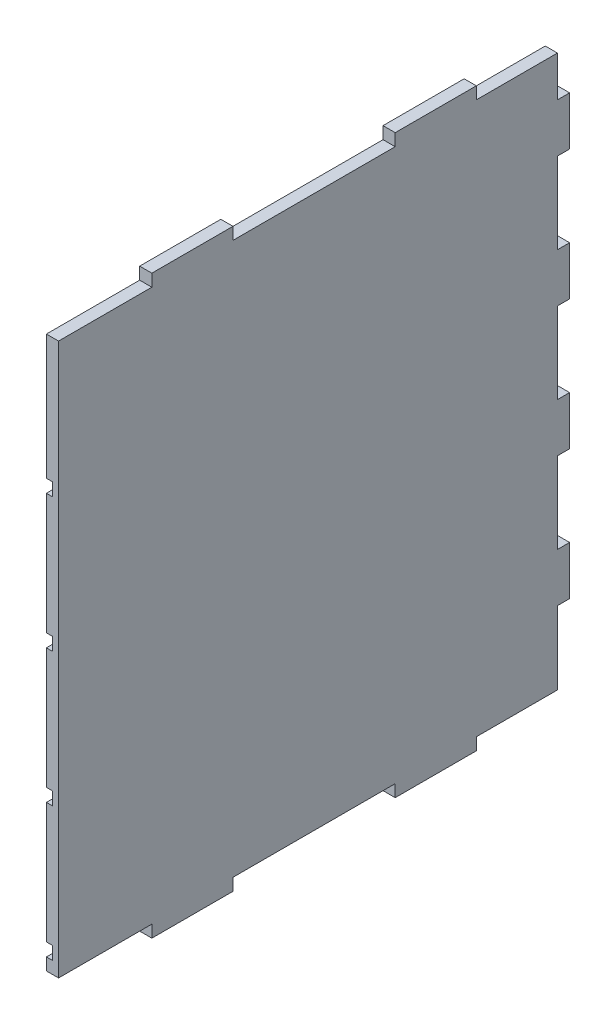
ISO-10303-21;
HEADER;
FILE_DESCRIPTION(('STEP AP214'),'2;1');
FILE_NAME('part.step','',(''),(''),'','','');
FILE_SCHEMA(('AUTOMOTIVE_DESIGN { 1 0 10303 214 1 1 1 1 }'));
ENDSEC;
DATA;
#1=APPLICATION_CONTEXT('core data for automotive mechanical design processes');
#2=APPLICATION_PROTOCOL_DEFINITION('international standard','automotive_design',2000,#1);
#3=PRODUCT_CONTEXT('',#1,'mechanical');
#4=PRODUCT('Part','Part','',(#3));
#5=PRODUCT_RELATED_PRODUCT_CATEGORY('part','',(#4));
#6=PRODUCT_DEFINITION_FORMATION('','',#4);
#7=PRODUCT_DEFINITION_CONTEXT('part definition',#1,'design');
#8=PRODUCT_DEFINITION('design','',#6,#7);
#9=PRODUCT_DEFINITION_SHAPE('','',#8);
#10=(LENGTH_UNIT() NAMED_UNIT(*) SI_UNIT(.MILLI.,.METRE.));
#11=(NAMED_UNIT(*) PLANE_ANGLE_UNIT() SI_UNIT($,.RADIAN.));
#12=(NAMED_UNIT(*) SI_UNIT($,.STERADIAN.) SOLID_ANGLE_UNIT());
#13=UNCERTAINTY_MEASURE_WITH_UNIT(LENGTH_MEASURE(1.E-05),#10,'distance_accuracy_value','');
#14=(GEOMETRIC_REPRESENTATION_CONTEXT(3) GLOBAL_UNCERTAINTY_ASSIGNED_CONTEXT((#13)) GLOBAL_UNIT_ASSIGNED_CONTEXT((#10,
#11,#12)) REPRESENTATION_CONTEXT('',''));
#15=CARTESIAN_POINT('',(0.,0.,0.));
#16=DIRECTION('',(0.,0.,1.));
#17=DIRECTION('',(1.,0.,0.));
#18=AXIS2_PLACEMENT_3D('',#15,#16,#17);
#19=CARTESIAN_POINT('',(0.,0.,0.));
#20=DIRECTION('',(0.,0.,1.));
#21=DIRECTION('',(1.,0.,0.));
#22=AXIS2_PLACEMENT_3D('',#19,#20,#21);
#23=PLANE('',#22);
#24=DIRECTION('',(0.,1.,0.));
#25=VECTOR('',#24,1.);
#26=CARTESIAN_POINT('',(0.,0.,0.));
#27=LINE('',#26,#25);
#28=CARTESIAN_POINT('',(0.,585.,5.03557756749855E-13));
#29=VERTEX_POINT('',#28);
#30=CARTESIAN_POINT('',(0.,645.,5.03557756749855E-13));
#31=VERTEX_POINT('',#30);
#32=EDGE_CURVE('E635',#29,#31,#27,.T.);
#33=ORIENTED_EDGE('',*,*,#32,.F.);
#34=DIRECTION('',(-1.,0.,0.));
#35=VECTOR('',#34,1.);
#36=CARTESIAN_POINT('',(0.,585.,5.03557756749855E-13));
#37=LINE('',#36,#35);
#38=CARTESIAN_POINT('',(-15.,585.,5.03557756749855E-13));
#39=VERTEX_POINT('',#38);
#40=EDGE_CURVE('E393',#29,#39,#37,.T.);
#41=ORIENTED_EDGE('',*,*,#40,.T.);
#42=DIRECTION('',(0.,-1.,0.));
#43=VECTOR('',#42,1.);
#44=CARTESIAN_POINT('',(-15.,541.,0.));
#45=LINE('',#44,#43);
#46=CARTESIAN_POINT('',(-15.,645.,5.03557756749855E-13));
#47=VERTEX_POINT('',#46);
#48=EDGE_CURVE('E681',#47,#39,#45,.T.);
#49=ORIENTED_EDGE('',*,*,#48,.F.);
#50=DIRECTION('',(-1.,0.,0.));
#51=VECTOR('',#50,1.);
#52=CARTESIAN_POINT('',(0.,645.,5.03557756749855E-13));
#53=LINE('',#52,#51);
#54=EDGE_CURVE('E406',#31,#47,#53,.T.);
#55=ORIENTED_EDGE('',*,*,#54,.F.);
#56=EDGE_LOOP('',(#33,#41,#49,#55));
#57=FACE_BOUND('',#56,.T.);
#58=ADVANCED_FACE('F33',(#57),#23,.F.);
#59=CARTESIAN_POINT('',(0.,265.,3.73439034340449E-13));
#60=VERTEX_POINT('',#59);
#61=CARTESIAN_POINT('',(0.,325.,0.));
#62=VERTEX_POINT('',#61);
#63=EDGE_CURVE('E682',#60,#62,#27,.T.);
#64=ORIENTED_EDGE('',*,*,#63,.F.);
#65=DIRECTION('',(-1.,0.,0.));
#66=VECTOR('',#65,1.);
#67=CARTESIAN_POINT('',(0.,265.,3.73439034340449E-13));
#68=LINE('',#67,#66);
#69=CARTESIAN_POINT('',(-15.,265.,3.73439034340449E-13));
#70=VERTEX_POINT('',#69);
#71=EDGE_CURVE('E410',#60,#70,#68,.T.);
#72=ORIENTED_EDGE('',*,*,#71,.T.);
#73=DIRECTION('',(0.,-1.,0.));
#74=VECTOR('',#73,1.);
#75=CARTESIAN_POINT('',(-15.,211.,0.));
#76=LINE('',#75,#74);
#77=CARTESIAN_POINT('',(-15.,325.,3.88624654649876E-13));
#78=VERTEX_POINT('',#77);
#79=EDGE_CURVE('E688',#78,#70,#76,.T.);
#80=ORIENTED_EDGE('',*,*,#79,.F.);
#81=DIRECTION('',(-1.,0.,0.));
#82=VECTOR('',#81,1.);
#83=CARTESIAN_POINT('',(0.,325.,3.88624654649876E-13));
#84=LINE('',#83,#82);
#85=EDGE_CURVE('E448',#62,#78,#84,.T.);
#86=ORIENTED_EDGE('',*,*,#85,.F.);
#87=EDGE_LOOP('',(#64,#72,#80,#86));
#88=FACE_BOUND('',#87,.T.);
#89=ADVANCED_FACE('F851',(#88),#23,.F.);
#90=DIRECTION('',(0.,-1.,0.));
#91=VECTOR('',#90,1.);
#92=CARTESIAN_POINT('',(-15.,376.,0.));
#93=LINE('',#92,#91);
#94=CARTESIAN_POINT('',(-15.,485.,4.58184592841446E-13));
#95=VERTEX_POINT('',#94);
#96=CARTESIAN_POINT('',(-15.,425.,4.24629270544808E-13));
#97=VERTEX_POINT('',#96);
#98=EDGE_CURVE('E685',#95,#97,#93,.T.);
#99=ORIENTED_EDGE('',*,*,#98,.F.);
#100=DIRECTION('',(-1.,0.,0.));
#101=VECTOR('',#100,1.);
#102=CARTESIAN_POINT('',(0.,485.,4.58184592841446E-13));
#103=LINE('',#102,#101);
#104=CARTESIAN_POINT('',(0.,485.,0.));
#105=VERTEX_POINT('',#104);
#106=EDGE_CURVE('E368',#105,#95,#103,.T.);
#107=ORIENTED_EDGE('',*,*,#106,.F.);
#108=CARTESIAN_POINT('',(0.,425.,4.24629270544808E-13));
#109=VERTEX_POINT('',#108);
#110=EDGE_CURVE('E382',#109,#105,#27,.T.);
#111=ORIENTED_EDGE('',*,*,#110,.F.);
#112=DIRECTION('',(-1.,0.,0.));
#113=VECTOR('',#112,1.);
#114=CARTESIAN_POINT('',(0.,425.,4.24629270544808E-13));
#115=LINE('',#114,#113);
#116=EDGE_CURVE('E429',#109,#97,#115,.T.);
#117=ORIENTED_EDGE('',*,*,#116,.T.);
#118=EDGE_LOOP('',(#99,#107,#111,#117));
#119=FACE_BOUND('',#118,.T.);
#120=ADVANCED_FACE('F895',(#119),#23,.F.);
#121=CARTESIAN_POINT('',(0.,710.,630.));
#122=DIRECTION('',(0.,-1.,0.));
#123=DIRECTION('',(0.,0.,-1.));
#124=AXIS2_PLACEMENT_3D('',#121,#122,#123);
#125=PLANE('',#124);
#126=DIRECTION('',(0.,0.,-1.));
#127=VECTOR('',#126,1.);
#128=CARTESIAN_POINT('',(0.,710.,630.));
#129=LINE('',#128,#127);
#130=CARTESIAN_POINT('',(0.,710.,215.));
#131=VERTEX_POINT('',#130);
#132=CARTESIAN_POINT('',(0.,710.,115.));
#133=VERTEX_POINT('',#132);
#134=EDGE_CURVE('E749',#131,#133,#129,.T.);
#135=ORIENTED_EDGE('',*,*,#134,.T.);
#136=DIRECTION('',(1.,0.,0.));
#137=VECTOR('',#136,1.);
#138=CARTESIAN_POINT('',(-15.0000000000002,710.,115.));
#139=LINE('',#138,#137);
#140=CARTESIAN_POINT('',(-15.0000000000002,710.,115.));
#141=VERTEX_POINT('',#140);
#142=EDGE_CURVE('E571',#141,#133,#139,.T.);
#143=ORIENTED_EDGE('',*,*,#142,.F.);
#144=DIRECTION('',(0.,0.,-1.));
#145=VECTOR('',#144,1.);
#146=CARTESIAN_POINT('',(-15.0000000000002,710.,630.));
#147=LINE('',#146,#145);
#148=CARTESIAN_POINT('',(-15.0000000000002,710.,215.));
#149=VERTEX_POINT('',#148);
#150=EDGE_CURVE('E745',#149,#141,#147,.T.);
#151=ORIENTED_EDGE('',*,*,#150,.F.);
#152=DIRECTION('',(1.,0.,0.));
#153=VECTOR('',#152,1.);
#154=CARTESIAN_POINT('',(-15.0000000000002,710.,215.));
#155=LINE('',#154,#153);
#156=EDGE_CURVE('E608',#149,#131,#155,.T.);
#157=ORIENTED_EDGE('',*,*,#156,.T.);
#158=EDGE_LOOP('',(#135,#143,#151,#157));
#159=FACE_BOUND('',#158,.T.);
#160=ADVANCED_FACE('F875',(#159),#125,.F.);
#161=CARTESIAN_POINT('',(0.,0.,630.));
#162=DIRECTION('',(0.,1.,0.));
#163=DIRECTION('',(-1.,0.,0.));
#164=AXIS2_PLACEMENT_3D('',#161,#162,#163);
#165=PLANE('',#164);
#166=DIRECTION('',(0.,0.,-1.));
#167=VECTOR('',#166,1.);
#168=CARTESIAN_POINT('',(-15.,0.,630.));
#169=LINE('',#168,#167);
#170=CARTESIAN_POINT('',(-15.0000000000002,0.,515.));
#171=VERTEX_POINT('',#170);
#172=CARTESIAN_POINT('',(-15.0000000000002,0.,415.));
#173=VERTEX_POINT('',#172);
#174=EDGE_CURVE('E696',#171,#173,#169,.T.);
#175=ORIENTED_EDGE('',*,*,#174,.T.);
#176=DIRECTION('',(1.,0.,0.));
#177=VECTOR('',#176,1.);
#178=CARTESIAN_POINT('',(-15.0000000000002,0.,415.));
#179=LINE('',#178,#177);
#180=CARTESIAN_POINT('',(0.,0.,415.));
#181=VERTEX_POINT('',#180);
#182=EDGE_CURVE('E537',#173,#181,#179,.T.);
#183=ORIENTED_EDGE('',*,*,#182,.T.);
#184=DIRECTION('',(0.,0.,-1.));
#185=VECTOR('',#184,1.);
#186=CARTESIAN_POINT('',(0.,0.,630.));
#187=LINE('',#186,#185);
#188=CARTESIAN_POINT('',(0.,0.,515.));
#189=VERTEX_POINT('',#188);
#190=EDGE_CURVE('E693',#189,#181,#187,.T.);
#191=ORIENTED_EDGE('',*,*,#190,.F.);
#192=DIRECTION('',(1.,0.,0.));
#193=VECTOR('',#192,1.);
#194=CARTESIAN_POINT('',(-15.0000000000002,0.,515.));
#195=LINE('',#194,#193);
#196=EDGE_CURVE('E553',#171,#189,#195,.T.);
#197=ORIENTED_EDGE('',*,*,#196,.F.);
#198=EDGE_LOOP('',(#175,#183,#191,#197));
#199=FACE_BOUND('',#198,.T.);
#200=ADVANCED_FACE('F798',(#199),#165,.F.);
#201=CARTESIAN_POINT('',(0.,0.,630.));
#202=DIRECTION('',(-1.,0.,0.));
#203=DIRECTION('',(0.,0.,1.));
#204=AXIS2_PLACEMENT_3D('',#201,#202,#203);
#205=PLANE('',#204);
#206=DIRECTION('',(0.,1.,0.));
#207=VECTOR('',#206,1.);
#208=CARTESIAN_POINT('',(0.,585.,15.));
#209=LINE('',#208,#207);
#210=CARTESIAN_POINT('',(0.,485.,15.));
#211=VERTEX_POINT('',#210);
#212=CARTESIAN_POINT('',(0.,585.,15.));
#213=VERTEX_POINT('',#212);
#214=EDGE_CURVE('E371',#211,#213,#209,.T.);
#215=ORIENTED_EDGE('',*,*,#214,.T.);
#216=DIRECTION('',(0.,0.,-1.));
#217=VECTOR('',#216,1.);
#218=CARTESIAN_POINT('',(0.,585.,5.03557756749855E-13));
#219=LINE('',#218,#217);
#220=EDGE_CURVE('E377',#213,#29,#219,.T.);
#221=ORIENTED_EDGE('',*,*,#220,.T.);
#222=ORIENTED_EDGE('',*,*,#32,.T.);
#223=DIRECTION('',(0.,0.,1.));
#224=VECTOR('',#223,1.);
#225=CARTESIAN_POINT('',(0.,645.,5.03557756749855E-13));
#226=LINE('',#225,#224);
#227=CARTESIAN_POINT('',(0.,645.,15.));
#228=VERTEX_POINT('',#227);
#229=EDGE_CURVE('E399',#31,#228,#226,.T.);
#230=ORIENTED_EDGE('',*,*,#229,.T.);
#231=DIRECTION('',(0.,1.,0.));
#232=VECTOR('',#231,1.);
#233=CARTESIAN_POINT('',(0.,645.,15.));
#234=LINE('',#233,#232);
#235=CARTESIAN_POINT('',(0.,695.,15.));
#236=VERTEX_POINT('',#235);
#237=EDGE_CURVE('E402',#228,#236,#234,.T.);
#238=ORIENTED_EDGE('',*,*,#237,.T.);
#239=DIRECTION('',(0.,0.,-1.));
#240=VECTOR('',#239,1.);
#241=CARTESIAN_POINT('',(0.,695.,0.));
#242=LINE('',#241,#240);
#243=CARTESIAN_POINT('',(0.,695.,115.));
#244=VERTEX_POINT('',#243);
#245=EDGE_CURVE('E572',#244,#236,#242,.T.);
#246=ORIENTED_EDGE('',*,*,#245,.F.);
#247=DIRECTION('',(0.,-1.,0.));
#248=VECTOR('',#247,1.);
#249=CARTESIAN_POINT('',(0.,695.,115.));
#250=LINE('',#249,#248);
#251=EDGE_CURVE('E568',#133,#244,#250,.T.);
#252=ORIENTED_EDGE('',*,*,#251,.F.);
#253=ORIENTED_EDGE('',*,*,#134,.F.);
#254=DIRECTION('',(0.,1.,0.));
#255=VECTOR('',#254,1.);
#256=CARTESIAN_POINT('',(0.,710.,215.));
#257=LINE('',#256,#255);
#258=CARTESIAN_POINT('',(0.,695.,215.));
#259=VERTEX_POINT('',#258);
#260=EDGE_CURVE('E580',#259,#131,#257,.T.);
#261=ORIENTED_EDGE('',*,*,#260,.F.);
#262=DIRECTION('',(0.,0.,-1.));
#263=VECTOR('',#262,1.);
#264=CARTESIAN_POINT('',(0.,695.,215.));
#265=LINE('',#264,#263);
#266=CARTESIAN_POINT('',(0.,695.,415.));
#267=VERTEX_POINT('',#266);
#268=EDGE_CURVE('E602',#267,#259,#265,.T.);
#269=ORIENTED_EDGE('',*,*,#268,.F.);
#270=DIRECTION('',(0.,-1.,0.));
#271=VECTOR('',#270,1.);
#272=CARTESIAN_POINT('',(0.,695.,415.));
#273=LINE('',#272,#271);
#274=CARTESIAN_POINT('',(0.,710.,415.));
#275=VERTEX_POINT('',#274);
#276=EDGE_CURVE('E610',#275,#267,#273,.T.);
#277=ORIENTED_EDGE('',*,*,#276,.F.);
#278=CARTESIAN_POINT('',(0.,710.,515.));
#279=VERTEX_POINT('',#278);
#280=EDGE_CURVE('E751',#279,#275,#129,.T.);
#281=ORIENTED_EDGE('',*,*,#280,.F.);
#282=DIRECTION('',(0.,1.,0.));
#283=VECTOR('',#282,1.);
#284=CARTESIAN_POINT('',(0.,695.,515.));
#285=LINE('',#284,#283);
#286=CARTESIAN_POINT('',(0.,695.,515.));
#287=VERTEX_POINT('',#286);
#288=EDGE_CURVE('E586',#287,#279,#285,.T.);
#289=ORIENTED_EDGE('',*,*,#288,.F.);
#290=DIRECTION('',(0.,0.,-1.));
#291=VECTOR('',#290,1.);
#292=CARTESIAN_POINT('',(0.,695.,630.));
#293=LINE('',#292,#291);
#294=CARTESIAN_POINT('',(0.,695.,630.));
#295=VERTEX_POINT('',#294);
#296=EDGE_CURVE('E517',#295,#287,#293,.T.);
#297=ORIENTED_EDGE('',*,*,#296,.F.);
#298=DIRECTION('',(0.,1.,0.));
#299=VECTOR('',#298,1.);
#300=CARTESIAN_POINT('',(0.,0.,630.));
#301=LINE('',#300,#299);
#302=CARTESIAN_POINT('',(0.,15.,630.));
#303=VERTEX_POINT('',#302);
#304=EDGE_CURVE('E638',#303,#295,#301,.T.);
#305=ORIENTED_EDGE('',*,*,#304,.F.);
#306=DIRECTION('',(0.,0.,1.));
#307=VECTOR('',#306,1.);
#308=CARTESIAN_POINT('',(0.,15.,630.));
#309=LINE('',#308,#307);
#310=CARTESIAN_POINT('',(0.,15.,515.));
#311=VERTEX_POINT('',#310);
#312=EDGE_CURVE('E550',#311,#303,#309,.T.);
#313=ORIENTED_EDGE('',*,*,#312,.F.);
#314=DIRECTION('',(0.,1.,0.));
#315=VECTOR('',#314,1.);
#316=CARTESIAN_POINT('',(0.,15.,515.));
#317=LINE('',#316,#315);
#318=EDGE_CURVE('E554',#189,#311,#317,.T.);
#319=ORIENTED_EDGE('',*,*,#318,.F.);
#320=ORIENTED_EDGE('',*,*,#190,.T.);
#321=DIRECTION('',(0.,-1.,0.));
#322=VECTOR('',#321,1.);
#323=CARTESIAN_POINT('',(0.,15.,415.));
#324=LINE('',#323,#322);
#325=CARTESIAN_POINT('',(0.,15.,415.));
#326=VERTEX_POINT('',#325);
#327=EDGE_CURVE('E522',#326,#181,#324,.T.);
#328=ORIENTED_EDGE('',*,*,#327,.F.);
#329=DIRECTION('',(0.,0.,1.));
#330=VECTOR('',#329,1.);
#331=CARTESIAN_POINT('',(0.,15.,215.));
#332=LINE('',#331,#330);
#333=CARTESIAN_POINT('',(0.,15.,215.));
#334=VERTEX_POINT('',#333);
#335=EDGE_CURVE('E532',#334,#326,#332,.T.);
#336=ORIENTED_EDGE('',*,*,#335,.F.);
#337=DIRECTION('',(0.,1.,0.));
#338=VECTOR('',#337,1.);
#339=CARTESIAN_POINT('',(0.,0.,215.));
#340=LINE('',#339,#338);
#341=CARTESIAN_POINT('',(0.,0.,215.));
#342=VERTEX_POINT('',#341);
#343=EDGE_CURVE('E529',#342,#334,#340,.T.);
#344=ORIENTED_EDGE('',*,*,#343,.F.);
#345=CARTESIAN_POINT('',(0.,0.,115.));
#346=VERTEX_POINT('',#345);
#347=EDGE_CURVE('E677',#342,#346,#187,.T.);
#348=ORIENTED_EDGE('',*,*,#347,.T.);
#349=DIRECTION('',(0.,-1.,0.));
#350=VECTOR('',#349,1.);
#351=CARTESIAN_POINT('',(0.,15.,115.));
#352=LINE('',#351,#350);
#353=CARTESIAN_POINT('',(0.,15.,115.));
#354=VERTEX_POINT('',#353);
#355=EDGE_CURVE('E625',#354,#346,#352,.T.);
#356=ORIENTED_EDGE('',*,*,#355,.F.);
#357=DIRECTION('',(0.,0.,1.));
#358=VECTOR('',#357,1.);
#359=CARTESIAN_POINT('',(0.,15.,0.));
#360=LINE('',#359,#358);
#361=CARTESIAN_POINT('',(0.,15.,15.));
#362=VERTEX_POINT('',#361);
#363=EDGE_CURVE('E540',#362,#354,#360,.T.);
#364=ORIENTED_EDGE('',*,*,#363,.F.);
#365=DIRECTION('',(0.,1.,0.));
#366=VECTOR('',#365,1.);
#367=CARTESIAN_POINT('',(0.,105.,15.));
#368=LINE('',#367,#366);
#369=CARTESIAN_POINT('',(0.,105.,15.));
#370=VERTEX_POINT('',#369);
#371=EDGE_CURVE('E491',#362,#370,#368,.T.);
#372=ORIENTED_EDGE('',*,*,#371,.T.);
#373=DIRECTION('',(0.,0.,-1.));
#374=VECTOR('',#373,1.);
#375=CARTESIAN_POINT('',(0.,105.,3.73683963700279E-13));
#376=LINE('',#375,#374);
#377=CARTESIAN_POINT('',(0.,105.,3.73683963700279E-13));
#378=VERTEX_POINT('',#377);
#379=EDGE_CURVE('E494',#370,#378,#376,.T.);
#380=ORIENTED_EDGE('',*,*,#379,.T.);
#381=CARTESIAN_POINT('',(0.,165.,0.));
#382=VERTEX_POINT('',#381);
#383=EDGE_CURVE('E678',#378,#382,#27,.T.);
#384=ORIENTED_EDGE('',*,*,#383,.T.);
#385=DIRECTION('',(0.,0.,1.));
#386=VECTOR('',#385,1.);
#387=CARTESIAN_POINT('',(0.,165.,3.73439034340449E-13));
#388=LINE('',#387,#386);
#389=CARTESIAN_POINT('',(0.,165.,15.));
#390=VERTEX_POINT('',#389);
#391=EDGE_CURVE('E414',#382,#390,#388,.T.);
#392=ORIENTED_EDGE('',*,*,#391,.T.);
#393=DIRECTION('',(0.,1.,0.));
#394=VECTOR('',#393,1.);
#395=CARTESIAN_POINT('',(0.,265.,15.));
#396=LINE('',#395,#394);
#397=CARTESIAN_POINT('',(0.,265.,15.));
#398=VERTEX_POINT('',#397);
#399=EDGE_CURVE('E417',#390,#398,#396,.T.);
#400=ORIENTED_EDGE('',*,*,#399,.T.);
#401=DIRECTION('',(0.,0.,-1.));
#402=VECTOR('',#401,1.);
#403=CARTESIAN_POINT('',(0.,265.,3.73439034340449E-13));
#404=LINE('',#403,#402);
#405=EDGE_CURVE('E421',#398,#60,#404,.T.);
#406=ORIENTED_EDGE('',*,*,#405,.T.);
#407=ORIENTED_EDGE('',*,*,#63,.T.);
#408=DIRECTION('',(0.,0.,1.));
#409=VECTOR('',#408,1.);
#410=CARTESIAN_POINT('',(0.,325.,3.88624654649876E-13));
#411=LINE('',#410,#409);
#412=CARTESIAN_POINT('',(0.,325.,15.));
#413=VERTEX_POINT('',#412);
#414=EDGE_CURVE('E56',#62,#413,#411,.T.);
#415=ORIENTED_EDGE('',*,*,#414,.T.);
#416=DIRECTION('',(0.,1.,0.));
#417=VECTOR('',#416,1.);
#418=CARTESIAN_POINT('',(0.,425.,15.));
#419=LINE('',#418,#417);
#420=CARTESIAN_POINT('',(0.,425.,15.));
#421=VERTEX_POINT('',#420);
#422=EDGE_CURVE('E442',#413,#421,#419,.T.);
#423=ORIENTED_EDGE('',*,*,#422,.T.);
#424=DIRECTION('',(0.,0.,-1.));
#425=VECTOR('',#424,1.);
#426=CARTESIAN_POINT('',(0.,425.,4.24629270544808E-13));
#427=LINE('',#426,#425);
#428=EDGE_CURVE('E446',#421,#109,#427,.T.);
#429=ORIENTED_EDGE('',*,*,#428,.T.);
#430=ORIENTED_EDGE('',*,*,#110,.T.);
#431=DIRECTION('',(0.,0.,1.));
#432=VECTOR('',#431,1.);
#433=CARTESIAN_POINT('',(0.,485.,4.58184592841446E-13));
#434=LINE('',#433,#432);
#435=EDGE_CURVE('E48',#105,#211,#434,.T.);
#436=ORIENTED_EDGE('',*,*,#435,.T.);
#437=EDGE_LOOP('',(#215,#221,#222,#230,#238,#246,#252,#253,#261,#269,#277,#281,#289,#297,#305,
#313,#319,#320,#328,#336,#344,#348,#356,#364,#372,#380,#384,#392,#400,#406,#407,#415,#423,#429,
#430,#436));
#438=FACE_BOUND('',#437,.T.);
#439=ADVANCED_FACE('F35',(#438),#205,.F.);
#440=CARTESIAN_POINT('',(-15.0000000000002,710.,515.));
#441=VERTEX_POINT('',#440);
#442=CARTESIAN_POINT('',(-15.0000000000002,710.,415.));
#443=VERTEX_POINT('',#442);
#444=EDGE_CURVE('E748',#441,#443,#147,.T.);
#445=ORIENTED_EDGE('',*,*,#444,.F.);
#446=DIRECTION('',(1.,0.,0.));
#447=VECTOR('',#446,1.);
#448=CARTESIAN_POINT('',(-15.0000000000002,710.,515.));
#449=LINE('',#448,#447);
#450=EDGE_CURVE('E594',#441,#279,#449,.T.);
#451=ORIENTED_EDGE('',*,*,#450,.T.);
#452=ORIENTED_EDGE('',*,*,#280,.T.);
#453=DIRECTION('',(1.,0.,0.));
#454=VECTOR('',#453,1.);
#455=CARTESIAN_POINT('',(-15.0000000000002,710.,415.));
#456=LINE('',#455,#454);
#457=EDGE_CURVE('E618',#443,#275,#456,.T.);
#458=ORIENTED_EDGE('',*,*,#457,.F.);
#459=EDGE_LOOP('',(#445,#451,#452,#458));
#460=FACE_BOUND('',#459,.T.);
#461=ADVANCED_FACE('F761',(#460),#125,.F.);
#462=CARTESIAN_POINT('',(-15.,541.,630.));
#463=DIRECTION('',(1.,0.,0.));
#464=DIRECTION('',(0.,1.,0.));
#465=AXIS2_PLACEMENT_3D('',#462,#463,#464);
#466=PLANE('',#465);
#467=ORIENTED_EDGE('',*,*,#48,.T.);
#468=DIRECTION('',(0.,0.,-1.));
#469=VECTOR('',#468,1.);
#470=CARTESIAN_POINT('',(-15.,585.,5.03557756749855E-13));
#471=LINE('',#470,#469);
#472=CARTESIAN_POINT('',(-15.,585.,15.));
#473=VERTEX_POINT('',#472);
#474=EDGE_CURVE('E383',#473,#39,#471,.T.);
#475=ORIENTED_EDGE('',*,*,#474,.F.);
#476=DIRECTION('',(0.,1.,0.));
#477=VECTOR('',#476,1.);
#478=CARTESIAN_POINT('',(-15.,585.,15.));
#479=LINE('',#478,#477);
#480=CARTESIAN_POINT('',(-15.,541.,15.));
#481=VERTEX_POINT('',#480);
#482=EDGE_CURVE('E390',#481,#473,#479,.T.);
#483=ORIENTED_EDGE('',*,*,#482,.F.);
#484=DIRECTION('',(0.,0.,-1.));
#485=VECTOR('',#484,1.);
#486=CARTESIAN_POINT('',(-15.,541.,630.));
#487=LINE('',#486,#485);
#488=CARTESIAN_POINT('',(-15.,541.,630.));
#489=VERTEX_POINT('',#488);
#490=EDGE_CURVE('E742',#489,#481,#487,.T.);
#491=ORIENTED_EDGE('',*,*,#490,.F.);
#492=DIRECTION('',(0.,-1.,0.));
#493=VECTOR('',#492,1.);
#494=CARTESIAN_POINT('',(-15.,541.,630.));
#495=LINE('',#494,#493);
#496=CARTESIAN_POINT('',(-15.0000000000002,695.,630.));
#497=VERTEX_POINT('',#496);
#498=EDGE_CURVE('E641',#497,#489,#495,.T.);
#499=ORIENTED_EDGE('',*,*,#498,.F.);
#500=DIRECTION('',(0.,0.,-1.));
#501=VECTOR('',#500,1.);
#502=CARTESIAN_POINT('',(-15.0000000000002,695.,630.));
#503=LINE('',#502,#501);
#504=CARTESIAN_POINT('',(-15.0000000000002,695.,515.));
#505=VERTEX_POINT('',#504);
#506=EDGE_CURVE('E582',#497,#505,#503,.T.);
#507=ORIENTED_EDGE('',*,*,#506,.T.);
#508=DIRECTION('',(0.,1.,0.));
#509=VECTOR('',#508,1.);
#510=CARTESIAN_POINT('',(-15.0000000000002,695.,515.));
#511=LINE('',#510,#509);
#512=EDGE_CURVE('E585',#505,#441,#511,.T.);
#513=ORIENTED_EDGE('',*,*,#512,.T.);
#514=ORIENTED_EDGE('',*,*,#444,.T.);
#515=DIRECTION('',(0.,-1.,0.));
#516=VECTOR('',#515,1.);
#517=CARTESIAN_POINT('',(-15.0000000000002,695.,415.));
#518=LINE('',#517,#516);
#519=CARTESIAN_POINT('',(-15.0000000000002,695.,415.));
#520=VERTEX_POINT('',#519);
#521=EDGE_CURVE('E601',#443,#520,#518,.T.);
#522=ORIENTED_EDGE('',*,*,#521,.T.);
#523=DIRECTION('',(0.,0.,-1.));
#524=VECTOR('',#523,1.);
#525=CARTESIAN_POINT('',(-15.0000000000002,695.,215.));
#526=LINE('',#525,#524);
#527=CARTESIAN_POINT('',(-15.0000000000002,695.,215.));
#528=VERTEX_POINT('',#527);
#529=EDGE_CURVE('E605',#520,#528,#526,.T.);
#530=ORIENTED_EDGE('',*,*,#529,.T.);
#531=DIRECTION('',(0.,1.,0.));
#532=VECTOR('',#531,1.);
#533=CARTESIAN_POINT('',(-15.0000000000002,710.,215.));
#534=LINE('',#533,#532);
#535=EDGE_CURVE('E598',#528,#149,#534,.T.);
#536=ORIENTED_EDGE('',*,*,#535,.T.);
#537=ORIENTED_EDGE('',*,*,#150,.T.);
#538=DIRECTION('',(0.,-1.,0.));
#539=VECTOR('',#538,1.);
#540=CARTESIAN_POINT('',(-15.0000000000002,695.,115.));
#541=LINE('',#540,#539);
#542=CARTESIAN_POINT('',(-15.0000000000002,695.,115.));
#543=VERTEX_POINT('',#542);
#544=EDGE_CURVE('E567',#141,#543,#541,.T.);
#545=ORIENTED_EDGE('',*,*,#544,.T.);
#546=DIRECTION('',(0.,0.,-1.));
#547=VECTOR('',#546,1.);
#548=CARTESIAN_POINT('',(-15.0000000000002,695.,0.));
#549=LINE('',#548,#547);
#550=CARTESIAN_POINT('',(-15.0000000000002,695.,15.));
#551=VERTEX_POINT('',#550);
#552=EDGE_CURVE('E564',#543,#551,#549,.T.);
#553=ORIENTED_EDGE('',*,*,#552,.T.);
#554=DIRECTION('',(0.,1.,0.));
#555=VECTOR('',#554,1.);
#556=CARTESIAN_POINT('',(-15.,645.,15.));
#557=LINE('',#556,#555);
#558=CARTESIAN_POINT('',(-15.,645.,15.));
#559=VERTEX_POINT('',#558);
#560=EDGE_CURVE('E403',#559,#551,#557,.T.);
#561=ORIENTED_EDGE('',*,*,#560,.F.);
#562=DIRECTION('',(0.,0.,1.));
#563=VECTOR('',#562,1.);
#564=CARTESIAN_POINT('',(-15.,645.,5.03557756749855E-13));
#565=LINE('',#564,#563);
#566=EDGE_CURVE('E407',#47,#559,#565,.T.);
#567=ORIENTED_EDGE('',*,*,#566,.F.);
#568=EDGE_LOOP('',(#467,#475,#483,#491,#499,#507,#513,#514,#522,#530,#536,#537,#545,#553,#561,#567));
#569=FACE_BOUND('',#568,.T.);
#570=ADVANCED_FACE('F772',(#569),#466,.F.);
#571=CARTESIAN_POINT('',(-7.50000000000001,541.,630.));
#572=DIRECTION('',(0.,1.,0.));
#573=DIRECTION('',(0.,0.,1.));
#574=AXIS2_PLACEMENT_3D('',#571,#572,#573);
#575=PLANE('',#574);
#576=ORIENTED_EDGE('',*,*,#490,.T.);
#577=DIRECTION('',(1.,0.,0.));
#578=VECTOR('',#577,1.);
#579=CARTESIAN_POINT('',(-7.50000000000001,541.,15.));
#580=LINE('',#579,#578);
#581=CARTESIAN_POINT('',(-7.50000000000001,541.,15.));
#582=VERTEX_POINT('',#581);
#583=EDGE_CURVE('E487',#481,#582,#580,.T.);
#584=ORIENTED_EDGE('',*,*,#583,.T.);
#585=DIRECTION('',(0.,0.,-1.));
#586=VECTOR('',#585,1.);
#587=CARTESIAN_POINT('',(-7.50000000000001,541.,630.));
#588=LINE('',#587,#586);
#589=CARTESIAN_POINT('',(-7.50000000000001,541.,630.));
#590=VERTEX_POINT('',#589);
#591=EDGE_CURVE('E739',#590,#582,#588,.T.);
#592=ORIENTED_EDGE('',*,*,#591,.F.);
#593=DIRECTION('',(1.,0.,0.));
#594=VECTOR('',#593,1.);
#595=CARTESIAN_POINT('',(-7.50000000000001,541.,630.));
#596=LINE('',#595,#594);
#597=EDGE_CURVE('E644',#489,#590,#596,.T.);
#598=ORIENTED_EDGE('',*,*,#597,.F.);
#599=EDGE_LOOP('',(#576,#584,#592,#598));
#600=FACE_BOUND('',#599,.T.);
#601=ADVANCED_FACE('F926',(#600),#575,.F.);
#602=CARTESIAN_POINT('',(-7.5,525.,630.));
#603=DIRECTION('',(1.,0.,0.));
#604=DIRECTION('',(0.,1.,0.));
#605=AXIS2_PLACEMENT_3D('',#602,#603,#604);
#606=PLANE('',#605);
#607=ORIENTED_EDGE('',*,*,#591,.T.);
#608=DIRECTION('',(0.,-1.,0.));
#609=VECTOR('',#608,1.);
#610=CARTESIAN_POINT('',(-7.5,525.,15.));
#611=LINE('',#610,#609);
#612=CARTESIAN_POINT('',(-7.5,525.,15.));
#613=VERTEX_POINT('',#612);
#614=EDGE_CURVE('E484',#582,#613,#611,.T.);
#615=ORIENTED_EDGE('',*,*,#614,.T.);
#616=DIRECTION('',(0.,0.,-1.));
#617=VECTOR('',#616,1.);
#618=CARTESIAN_POINT('',(-7.5,525.,630.));
#619=LINE('',#618,#617);
#620=CARTESIAN_POINT('',(-7.5,525.,630.));
#621=VERTEX_POINT('',#620);
#622=EDGE_CURVE('E736',#621,#613,#619,.T.);
#623=ORIENTED_EDGE('',*,*,#622,.F.);
#624=DIRECTION('',(0.,-1.,0.));
#625=VECTOR('',#624,1.);
#626=CARTESIAN_POINT('',(-7.5,525.,630.));
#627=LINE('',#626,#625);
#628=EDGE_CURVE('E646',#590,#621,#627,.T.);
#629=ORIENTED_EDGE('',*,*,#628,.F.);
#630=EDGE_LOOP('',(#607,#615,#623,#629));
#631=FACE_BOUND('',#630,.T.);
#632=ADVANCED_FACE('F922',(#631),#606,.F.);
#633=CARTESIAN_POINT('',(-15.,525.,630.));
#634=DIRECTION('',(0.,-1.,0.));
#635=DIRECTION('',(0.,0.,-1.));
#636=AXIS2_PLACEMENT_3D('',#633,#634,#635);
#637=PLANE('',#636);
#638=ORIENTED_EDGE('',*,*,#622,.T.);
#639=DIRECTION('',(-1.,0.,0.));
#640=VECTOR('',#639,1.);
#641=CARTESIAN_POINT('',(-15.,525.,15.));
#642=LINE('',#641,#640);
#643=CARTESIAN_POINT('',(-15.,525.,15.));
#644=VERTEX_POINT('',#643);
#645=EDGE_CURVE('E481',#613,#644,#642,.T.);
#646=ORIENTED_EDGE('',*,*,#645,.T.);
#647=DIRECTION('',(0.,0.,-1.));
#648=VECTOR('',#647,1.);
#649=CARTESIAN_POINT('',(-15.,525.,630.));
#650=LINE('',#649,#648);
#651=CARTESIAN_POINT('',(-15.,525.,630.));
#652=VERTEX_POINT('',#651);
#653=EDGE_CURVE('E733',#652,#644,#650,.T.);
#654=ORIENTED_EDGE('',*,*,#653,.F.);
#655=DIRECTION('',(-1.,0.,0.));
#656=VECTOR('',#655,1.);
#657=CARTESIAN_POINT('',(-15.,525.,630.));
#658=LINE('',#657,#656);
#659=EDGE_CURVE('E648',#621,#652,#658,.T.);
#660=ORIENTED_EDGE('',*,*,#659,.F.);
#661=EDGE_LOOP('',(#638,#646,#654,#660));
#662=FACE_BOUND('',#661,.T.);
#663=ADVANCED_FACE('F917',(#662),#637,.F.);
#664=CARTESIAN_POINT('',(-15.,376.,630.));
#665=DIRECTION('',(1.,0.,0.));
#666=DIRECTION('',(0.,0.,-1.));
#667=AXIS2_PLACEMENT_3D('',#664,#665,#666);
#668=PLANE('',#667);
#669=ORIENTED_EDGE('',*,*,#653,.T.);
#670=CARTESIAN_POINT('',(-15.,485.,15.));
#671=VERTEX_POINT('',#670);
#672=EDGE_CURVE('E385',#671,#644,#479,.T.);
#673=ORIENTED_EDGE('',*,*,#672,.F.);
#674=DIRECTION('',(0.,0.,1.));
#675=VECTOR('',#674,1.);
#676=CARTESIAN_POINT('',(-15.,485.,4.58184592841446E-13));
#677=LINE('',#676,#675);
#678=EDGE_CURVE('E364',#95,#671,#677,.T.);
#679=ORIENTED_EDGE('',*,*,#678,.F.);
#680=ORIENTED_EDGE('',*,*,#98,.T.);
#681=DIRECTION('',(0.,0.,-1.));
#682=VECTOR('',#681,1.);
#683=CARTESIAN_POINT('',(-15.,425.,4.24629270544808E-13));
#684=LINE('',#683,#682);
#685=CARTESIAN_POINT('',(-15.,425.,15.));
#686=VERTEX_POINT('',#685);
#687=EDGE_CURVE('E443',#686,#97,#684,.T.);
#688=ORIENTED_EDGE('',*,*,#687,.F.);
#689=DIRECTION('',(0.,1.,0.));
#690=VECTOR('',#689,1.);
#691=CARTESIAN_POINT('',(-15.,425.,15.));
#692=LINE('',#691,#690);
#693=CARTESIAN_POINT('',(-15.,376.,15.));
#694=VERTEX_POINT('',#693);
#695=EDGE_CURVE('E452',#694,#686,#692,.T.);
#696=ORIENTED_EDGE('',*,*,#695,.F.);
#697=DIRECTION('',(0.,0.,-1.));
#698=VECTOR('',#697,1.);
#699=CARTESIAN_POINT('',(-15.,376.,630.));
#700=LINE('',#699,#698);
#701=CARTESIAN_POINT('',(-15.,376.,630.));
#702=VERTEX_POINT('',#701);
#703=EDGE_CURVE('E730',#702,#694,#700,.T.);
#704=ORIENTED_EDGE('',*,*,#703,.F.);
#705=DIRECTION('',(0.,-1.,0.));
#706=VECTOR('',#705,1.);
#707=CARTESIAN_POINT('',(-15.,376.,630.));
#708=LINE('',#707,#706);
#709=EDGE_CURVE('E650',#652,#702,#708,.T.);
#710=ORIENTED_EDGE('',*,*,#709,.F.);
#711=EDGE_LOOP('',(#669,#673,#679,#680,#688,#696,#704,#710));
#712=FACE_BOUND('',#711,.T.);
#713=ADVANCED_FACE('F912',(#712),#668,.F.);
#714=CARTESIAN_POINT('',(-7.50000000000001,376.,630.));
#715=DIRECTION('',(0.,1.,0.));
#716=DIRECTION('',(-1.,0.,0.));
#717=AXIS2_PLACEMENT_3D('',#714,#715,#716);
#718=PLANE('',#717);
#719=ORIENTED_EDGE('',*,*,#703,.T.);
#720=DIRECTION('',(1.,0.,0.));
#721=VECTOR('',#720,1.);
#722=CARTESIAN_POINT('',(-7.50000000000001,376.,15.));
#723=LINE('',#722,#721);
#724=CARTESIAN_POINT('',(-7.50000000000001,376.,15.));
#725=VERTEX_POINT('',#724);
#726=EDGE_CURVE('E478',#694,#725,#723,.T.);
#727=ORIENTED_EDGE('',*,*,#726,.T.);
#728=DIRECTION('',(0.,0.,-1.));
#729=VECTOR('',#728,1.);
#730=CARTESIAN_POINT('',(-7.50000000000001,376.,630.));
#731=LINE('',#730,#729);
#732=CARTESIAN_POINT('',(-7.50000000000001,376.,630.));
#733=VERTEX_POINT('',#732);
#734=EDGE_CURVE('E727',#733,#725,#731,.T.);
#735=ORIENTED_EDGE('',*,*,#734,.F.);
#736=DIRECTION('',(1.,0.,0.));
#737=VECTOR('',#736,1.);
#738=CARTESIAN_POINT('',(-7.50000000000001,376.,630.));
#739=LINE('',#738,#737);
#740=EDGE_CURVE('E652',#702,#733,#739,.T.);
#741=ORIENTED_EDGE('',*,*,#740,.F.);
#742=EDGE_LOOP('',(#719,#727,#735,#741));
#743=FACE_BOUND('',#742,.T.);
#744=ADVANCED_FACE('F1274',(#743),#718,.F.);
#745=CARTESIAN_POINT('',(-7.5,360.,630.));
#746=DIRECTION('',(1.,0.,0.));
#747=DIRECTION('',(0.,1.,0.));
#748=AXIS2_PLACEMENT_3D('',#745,#746,#747);
#749=PLANE('',#748);
#750=ORIENTED_EDGE('',*,*,#734,.T.);
#751=DIRECTION('',(0.,-1.,0.));
#752=VECTOR('',#751,1.);
#753=CARTESIAN_POINT('',(-7.5,360.,15.));
#754=LINE('',#753,#752);
#755=CARTESIAN_POINT('',(-7.5,360.,15.));
#756=VERTEX_POINT('',#755);
#757=EDGE_CURVE('E475',#725,#756,#754,.T.);
#758=ORIENTED_EDGE('',*,*,#757,.T.);
#759=DIRECTION('',(0.,0.,-1.));
#760=VECTOR('',#759,1.);
#761=CARTESIAN_POINT('',(-7.5,360.,630.));
#762=LINE('',#761,#760);
#763=CARTESIAN_POINT('',(-7.5,360.,630.));
#764=VERTEX_POINT('',#763);
#765=EDGE_CURVE('E724',#764,#756,#762,.T.);
#766=ORIENTED_EDGE('',*,*,#765,.F.);
#767=DIRECTION('',(0.,-1.,0.));
#768=VECTOR('',#767,1.);
#769=CARTESIAN_POINT('',(-7.5,360.,630.));
#770=LINE('',#769,#768);
#771=EDGE_CURVE('E654',#733,#764,#770,.T.);
#772=ORIENTED_EDGE('',*,*,#771,.F.);
#773=EDGE_LOOP('',(#750,#758,#766,#772));
#774=FACE_BOUND('',#773,.T.);
#775=ADVANCED_FACE('F1265',(#774),#749,.F.);
#776=CARTESIAN_POINT('',(-15.,360.,630.));
#777=DIRECTION('',(0.,-1.,0.));
#778=DIRECTION('',(1.,0.,0.));
#779=AXIS2_PLACEMENT_3D('',#776,#777,#778);
#780=PLANE('',#779);
#781=ORIENTED_EDGE('',*,*,#765,.T.);
#782=DIRECTION('',(-1.,0.,0.));
#783=VECTOR('',#782,1.);
#784=CARTESIAN_POINT('',(-15.,360.,15.));
#785=LINE('',#784,#783);
#786=CARTESIAN_POINT('',(-15.,360.,15.));
#787=VERTEX_POINT('',#786);
#788=EDGE_CURVE('E472',#756,#787,#785,.T.);
#789=ORIENTED_EDGE('',*,*,#788,.T.);
#790=DIRECTION('',(0.,0.,-1.));
#791=VECTOR('',#790,1.);
#792=CARTESIAN_POINT('',(-15.,360.,630.));
#793=LINE('',#792,#791);
#794=CARTESIAN_POINT('',(-15.,360.,630.));
#795=VERTEX_POINT('',#794);
#796=EDGE_CURVE('E721',#795,#787,#793,.T.);
#797=ORIENTED_EDGE('',*,*,#796,.F.);
#798=DIRECTION('',(-1.,0.,0.));
#799=VECTOR('',#798,1.);
#800=CARTESIAN_POINT('',(-15.,360.,630.));
#801=LINE('',#800,#799);
#802=EDGE_CURVE('E656',#764,#795,#801,.T.);
#803=ORIENTED_EDGE('',*,*,#802,.F.);
#804=EDGE_LOOP('',(#781,#789,#797,#803));
#805=FACE_BOUND('',#804,.T.);
#806=ADVANCED_FACE('F1256',(#805),#780,.F.);
#807=CARTESIAN_POINT('',(-15.,211.,630.));
#808=DIRECTION('',(1.,0.,0.));
#809=DIRECTION('',(0.,0.,-1.));
#810=AXIS2_PLACEMENT_3D('',#807,#808,#809);
#811=PLANE('',#810);
#812=ORIENTED_EDGE('',*,*,#79,.T.);
#813=DIRECTION('',(0.,0.,-1.));
#814=VECTOR('',#813,1.);
#815=CARTESIAN_POINT('',(-15.,265.,3.73439034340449E-13));
#816=LINE('',#815,#814);
#817=CARTESIAN_POINT('',(-15.,265.,15.));
#818=VERTEX_POINT('',#817);
#819=EDGE_CURVE('E418',#818,#70,#816,.T.);
#820=ORIENTED_EDGE('',*,*,#819,.F.);
#821=DIRECTION('',(0.,1.,0.));
#822=VECTOR('',#821,1.);
#823=CARTESIAN_POINT('',(-15.,265.,15.));
#824=LINE('',#823,#822);
#825=CARTESIAN_POINT('',(-15.,211.,15.));
#826=VERTEX_POINT('',#825);
#827=EDGE_CURVE('E428',#826,#818,#824,.T.);
#828=ORIENTED_EDGE('',*,*,#827,.F.);
#829=DIRECTION('',(0.,0.,-1.));
#830=VECTOR('',#829,1.);
#831=CARTESIAN_POINT('',(-15.,211.,630.));
#832=LINE('',#831,#830);
#833=CARTESIAN_POINT('',(-15.,211.,630.));
#834=VERTEX_POINT('',#833);
#835=EDGE_CURVE('E718',#834,#826,#832,.T.);
#836=ORIENTED_EDGE('',*,*,#835,.F.);
#837=DIRECTION('',(0.,-1.,0.));
#838=VECTOR('',#837,1.);
#839=CARTESIAN_POINT('',(-15.,211.,630.));
#840=LINE('',#839,#838);
#841=EDGE_CURVE('E658',#795,#834,#840,.T.);
#842=ORIENTED_EDGE('',*,*,#841,.F.);
#843=ORIENTED_EDGE('',*,*,#796,.T.);
#844=CARTESIAN_POINT('',(-15.,325.,15.));
#845=VERTEX_POINT('',#844);
#846=EDGE_CURVE('E453',#845,#787,#692,.T.);
#847=ORIENTED_EDGE('',*,*,#846,.F.);
#848=DIRECTION('',(0.,0.,1.));
#849=VECTOR('',#848,1.);
#850=CARTESIAN_POINT('',(-15.,325.,3.88624654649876E-13));
#851=LINE('',#850,#849);
#852=EDGE_CURVE('E449',#78,#845,#851,.T.);
#853=ORIENTED_EDGE('',*,*,#852,.F.);
#854=EDGE_LOOP('',(#812,#820,#828,#836,#842,#843,#847,#853));
#855=FACE_BOUND('',#854,.T.);
#856=ADVANCED_FACE('F1247',(#855),#811,.F.);
#857=CARTESIAN_POINT('',(-7.50000000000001,211.,630.));
#858=DIRECTION('',(0.,1.,0.));
#859=DIRECTION('',(0.,0.,1.));
#860=AXIS2_PLACEMENT_3D('',#857,#858,#859);
#861=PLANE('',#860);
#862=ORIENTED_EDGE('',*,*,#835,.T.);
#863=DIRECTION('',(1.,0.,0.));
#864=VECTOR('',#863,1.);
#865=CARTESIAN_POINT('',(-7.50000000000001,211.,15.));
#866=LINE('',#865,#864);
#867=CARTESIAN_POINT('',(-7.50000000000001,211.,15.));
#868=VERTEX_POINT('',#867);
#869=EDGE_CURVE('E469',#826,#868,#866,.T.);
#870=ORIENTED_EDGE('',*,*,#869,.T.);
#871=DIRECTION('',(0.,0.,-1.));
#872=VECTOR('',#871,1.);
#873=CARTESIAN_POINT('',(-7.50000000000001,211.,630.));
#874=LINE('',#873,#872);
#875=CARTESIAN_POINT('',(-7.50000000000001,211.,630.));
#876=VERTEX_POINT('',#875);
#877=EDGE_CURVE('E715',#876,#868,#874,.T.);
#878=ORIENTED_EDGE('',*,*,#877,.F.);
#879=DIRECTION('',(1.,0.,0.));
#880=VECTOR('',#879,1.);
#881=CARTESIAN_POINT('',(-7.50000000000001,211.,630.));
#882=LINE('',#881,#880);
#883=EDGE_CURVE('E660',#834,#876,#882,.T.);
#884=ORIENTED_EDGE('',*,*,#883,.F.);
#885=EDGE_LOOP('',(#862,#870,#878,#884));
#886=FACE_BOUND('',#885,.T.);
#887=ADVANCED_FACE('F1238',(#886),#861,.F.);
#888=CARTESIAN_POINT('',(-7.5,195.,630.));
#889=DIRECTION('',(1.,0.,0.));
#890=DIRECTION('',(0.,1.,0.));
#891=AXIS2_PLACEMENT_3D('',#888,#889,#890);
#892=PLANE('',#891);
#893=ORIENTED_EDGE('',*,*,#877,.T.);
#894=DIRECTION('',(0.,-1.,0.));
#895=VECTOR('',#894,1.);
#896=CARTESIAN_POINT('',(-7.5,195.,15.));
#897=LINE('',#896,#895);
#898=CARTESIAN_POINT('',(-7.5,195.,15.));
#899=VERTEX_POINT('',#898);
#900=EDGE_CURVE('E466',#868,#899,#897,.T.);
#901=ORIENTED_EDGE('',*,*,#900,.T.);
#902=DIRECTION('',(0.,0.,-1.));
#903=VECTOR('',#902,1.);
#904=CARTESIAN_POINT('',(-7.5,195.,630.));
#905=LINE('',#904,#903);
#906=CARTESIAN_POINT('',(-7.5,195.,630.));
#907=VERTEX_POINT('',#906);
#908=EDGE_CURVE('E712',#907,#899,#905,.T.);
#909=ORIENTED_EDGE('',*,*,#908,.F.);
#910=DIRECTION('',(0.,-1.,0.));
#911=VECTOR('',#910,1.);
#912=CARTESIAN_POINT('',(-7.5,195.,630.));
#913=LINE('',#912,#911);
#914=EDGE_CURVE('E662',#876,#907,#913,.T.);
#915=ORIENTED_EDGE('',*,*,#914,.F.);
#916=EDGE_LOOP('',(#893,#901,#909,#915));
#917=FACE_BOUND('',#916,.T.);
#918=ADVANCED_FACE('F1229',(#917),#892,.F.);
#919=CARTESIAN_POINT('',(-15.,195.,630.));
#920=DIRECTION('',(0.,-1.,0.));
#921=DIRECTION('',(1.,0.,0.));
#922=AXIS2_PLACEMENT_3D('',#919,#920,#921);
#923=PLANE('',#922);
#924=ORIENTED_EDGE('',*,*,#908,.T.);
#925=DIRECTION('',(-1.,0.,0.));
#926=VECTOR('',#925,1.);
#927=CARTESIAN_POINT('',(-15.,195.,15.));
#928=LINE('',#927,#926);
#929=CARTESIAN_POINT('',(-15.,195.,15.));
#930=VERTEX_POINT('',#929);
#931=EDGE_CURVE('E396',#899,#930,#928,.T.);
#932=ORIENTED_EDGE('',*,*,#931,.T.);
#933=DIRECTION('',(0.,0.,-1.));
#934=VECTOR('',#933,1.);
#935=CARTESIAN_POINT('',(-15.,195.,630.));
#936=LINE('',#935,#934);
#937=CARTESIAN_POINT('',(-15.,195.,630.));
#938=VERTEX_POINT('',#937);
#939=EDGE_CURVE('E709',#938,#930,#936,.T.);
#940=ORIENTED_EDGE('',*,*,#939,.F.);
#941=DIRECTION('',(-1.,0.,0.));
#942=VECTOR('',#941,1.);
#943=CARTESIAN_POINT('',(-15.,195.,630.));
#944=LINE('',#943,#942);
#945=EDGE_CURVE('E664',#907,#938,#944,.T.);
#946=ORIENTED_EDGE('',*,*,#945,.F.);
#947=EDGE_LOOP('',(#924,#932,#940,#946));
#948=FACE_BOUND('',#947,.T.);
#949=ADVANCED_FACE('F1220',(#948),#923,.F.);
#950=CARTESIAN_POINT('',(-15.,46.,630.));
#951=DIRECTION('',(1.,0.,0.));
#952=DIRECTION('',(0.,0.,-1.));
#953=AXIS2_PLACEMENT_3D('',#950,#951,#952);
#954=PLANE('',#953);
#955=ORIENTED_EDGE('',*,*,#939,.T.);
#956=CARTESIAN_POINT('',(-15.,165.,15.));
#957=VERTEX_POINT('',#956);
#958=EDGE_CURVE('E430',#957,#930,#824,.T.);
#959=ORIENTED_EDGE('',*,*,#958,.F.);
#960=DIRECTION('',(0.,0.,1.));
#961=VECTOR('',#960,1.);
#962=CARTESIAN_POINT('',(-15.,165.,3.73439034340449E-13));
#963=LINE('',#962,#961);
#964=CARTESIAN_POINT('',(-15.,165.,3.73439034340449E-13));
#965=VERTEX_POINT('',#964);
#966=EDGE_CURVE('E425',#965,#957,#963,.T.);
#967=ORIENTED_EDGE('',*,*,#966,.F.);
#968=DIRECTION('',(0.,-1.,0.));
#969=VECTOR('',#968,1.);
#970=CARTESIAN_POINT('',(-15.,46.,0.));
#971=LINE('',#970,#969);
#972=CARTESIAN_POINT('',(-15.,105.,3.73683963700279E-13));
#973=VERTEX_POINT('',#972);
#974=EDGE_CURVE('E642',#965,#973,#971,.T.);
#975=ORIENTED_EDGE('',*,*,#974,.T.);
#976=DIRECTION('',(0.,0.,-1.));
#977=VECTOR('',#976,1.);
#978=CARTESIAN_POINT('',(-15.,105.,3.73683963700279E-13));
#979=LINE('',#978,#977);
#980=CARTESIAN_POINT('',(-15.,105.,15.));
#981=VERTEX_POINT('',#980);
#982=EDGE_CURVE('E495',#981,#973,#979,.T.);
#983=ORIENTED_EDGE('',*,*,#982,.F.);
#984=DIRECTION('',(0.,1.,0.));
#985=VECTOR('',#984,1.);
#986=CARTESIAN_POINT('',(-15.,105.,15.));
#987=LINE('',#986,#985);
#988=CARTESIAN_POINT('',(-15.,46.,15.));
#989=VERTEX_POINT('',#988);
#990=EDGE_CURVE('E490',#989,#981,#987,.T.);
#991=ORIENTED_EDGE('',*,*,#990,.F.);
#992=DIRECTION('',(0.,0.,-1.));
#993=VECTOR('',#992,1.);
#994=CARTESIAN_POINT('',(-15.,46.,630.));
#995=LINE('',#994,#993);
#996=CARTESIAN_POINT('',(-15.,46.,630.));
#997=VERTEX_POINT('',#996);
#998=EDGE_CURVE('E706',#997,#989,#995,.T.);
#999=ORIENTED_EDGE('',*,*,#998,.F.);
#1000=DIRECTION('',(0.,-1.,0.));
#1001=VECTOR('',#1000,1.);
#1002=CARTESIAN_POINT('',(-15.,46.,630.));
#1003=LINE('',#1002,#1001);
#1004=EDGE_CURVE('E666',#938,#997,#1003,.T.);
#1005=ORIENTED_EDGE('',*,*,#1004,.F.);
#1006=EDGE_LOOP('',(#955,#959,#967,#975,#983,#991,#999,#1005));
#1007=FACE_BOUND('',#1006,.T.);
#1008=ADVANCED_FACE('F1211',(#1007),#954,.F.);
#1009=CARTESIAN_POINT('',(-7.50000000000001,46.,630.));
#1010=DIRECTION('',(0.,1.,0.));
#1011=DIRECTION('',(-1.,0.,0.));
#1012=AXIS2_PLACEMENT_3D('',#1009,#1010,#1011);
#1013=PLANE('',#1012);
#1014=ORIENTED_EDGE('',*,*,#998,.T.);
#1015=DIRECTION('',(1.,0.,0.));
#1016=VECTOR('',#1015,1.);
#1017=CARTESIAN_POINT('',(-7.50000000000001,46.,15.));
#1018=LINE('',#1017,#1016);
#1019=CARTESIAN_POINT('',(-7.50000000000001,46.,15.));
#1020=VERTEX_POINT('',#1019);
#1021=EDGE_CURVE('E514',#989,#1020,#1018,.T.);
#1022=ORIENTED_EDGE('',*,*,#1021,.T.);
#1023=DIRECTION('',(0.,0.,-1.));
#1024=VECTOR('',#1023,1.);
#1025=CARTESIAN_POINT('',(-7.50000000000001,46.,630.));
#1026=LINE('',#1025,#1024);
#1027=CARTESIAN_POINT('',(-7.50000000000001,46.,630.));
#1028=VERTEX_POINT('',#1027);
#1029=EDGE_CURVE('E703',#1028,#1020,#1026,.T.);
#1030=ORIENTED_EDGE('',*,*,#1029,.F.);
#1031=DIRECTION('',(1.,0.,0.));
#1032=VECTOR('',#1031,1.);
#1033=CARTESIAN_POINT('',(-7.50000000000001,46.,630.));
#1034=LINE('',#1033,#1032);
#1035=EDGE_CURVE('E668',#997,#1028,#1034,.T.);
#1036=ORIENTED_EDGE('',*,*,#1035,.F.);
#1037=EDGE_LOOP('',(#1014,#1022,#1030,#1036));
#1038=FACE_BOUND('',#1037,.T.);
#1039=ADVANCED_FACE('F1202',(#1038),#1013,.F.);
#1040=CARTESIAN_POINT('',(-7.5,30.,630.));
#1041=DIRECTION('',(1.,0.,0.));
#1042=DIRECTION('',(0.,1.,0.));
#1043=AXIS2_PLACEMENT_3D('',#1040,#1041,#1042);
#1044=PLANE('',#1043);
#1045=ORIENTED_EDGE('',*,*,#1029,.T.);
#1046=DIRECTION('',(0.,-1.,0.));
#1047=VECTOR('',#1046,1.);
#1048=CARTESIAN_POINT('',(-7.5,30.,15.));
#1049=LINE('',#1048,#1047);
#1050=CARTESIAN_POINT('',(-7.5,30.,15.));
#1051=VERTEX_POINT('',#1050);
#1052=EDGE_CURVE('E511',#1020,#1051,#1049,.T.);
#1053=ORIENTED_EDGE('',*,*,#1052,.T.);
#1054=DIRECTION('',(0.,0.,-1.));
#1055=VECTOR('',#1054,1.);
#1056=CARTESIAN_POINT('',(-7.5,30.,630.));
#1057=LINE('',#1056,#1055);
#1058=CARTESIAN_POINT('',(-7.5,30.,630.));
#1059=VERTEX_POINT('',#1058);
#1060=EDGE_CURVE('E700',#1059,#1051,#1057,.T.);
#1061=ORIENTED_EDGE('',*,*,#1060,.F.);
#1062=DIRECTION('',(0.,-1.,0.));
#1063=VECTOR('',#1062,1.);
#1064=CARTESIAN_POINT('',(-7.5,30.,630.));
#1065=LINE('',#1064,#1063);
#1066=EDGE_CURVE('E670',#1028,#1059,#1065,.T.);
#1067=ORIENTED_EDGE('',*,*,#1066,.F.);
#1068=EDGE_LOOP('',(#1045,#1053,#1061,#1067));
#1069=FACE_BOUND('',#1068,.T.);
#1070=ADVANCED_FACE('F1193',(#1069),#1044,.F.);
#1071=CARTESIAN_POINT('',(-15.,30.,630.));
#1072=DIRECTION('',(0.,-1.,0.));
#1073=DIRECTION('',(1.,0.,0.));
#1074=AXIS2_PLACEMENT_3D('',#1071,#1072,#1073);
#1075=PLANE('',#1074);
#1076=ORIENTED_EDGE('',*,*,#1060,.T.);
#1077=DIRECTION('',(-1.,0.,0.));
#1078=VECTOR('',#1077,1.);
#1079=CARTESIAN_POINT('',(-15.,30.,15.));
#1080=LINE('',#1079,#1078);
#1081=CARTESIAN_POINT('',(-15.,30.,15.));
#1082=VERTEX_POINT('',#1081);
#1083=EDGE_CURVE('E506',#1051,#1082,#1080,.T.);
#1084=ORIENTED_EDGE('',*,*,#1083,.T.);
#1085=DIRECTION('',(0.,0.,-1.));
#1086=VECTOR('',#1085,1.);
#1087=CARTESIAN_POINT('',(-15.,30.,630.));
#1088=LINE('',#1087,#1086);
#1089=CARTESIAN_POINT('',(-15.,30.,630.));
#1090=VERTEX_POINT('',#1089);
#1091=EDGE_CURVE('E697',#1090,#1082,#1088,.T.);
#1092=ORIENTED_EDGE('',*,*,#1091,.F.);
#1093=DIRECTION('',(-1.,0.,0.));
#1094=VECTOR('',#1093,1.);
#1095=CARTESIAN_POINT('',(-15.,30.,630.));
#1096=LINE('',#1095,#1094);
#1097=EDGE_CURVE('E672',#1059,#1090,#1096,.T.);
#1098=ORIENTED_EDGE('',*,*,#1097,.F.);
#1099=EDGE_LOOP('',(#1076,#1084,#1092,#1098));
#1100=FACE_BOUND('',#1099,.T.);
#1101=ADVANCED_FACE('F1185',(#1100),#1075,.F.);
#1102=CARTESIAN_POINT('',(-15.,0.,630.));
#1103=DIRECTION('',(1.,0.,0.));
#1104=DIRECTION('',(0.,1.,0.));
#1105=AXIS2_PLACEMENT_3D('',#1102,#1103,#1104);
#1106=PLANE('',#1105);
#1107=ORIENTED_EDGE('',*,*,#1091,.T.);
#1108=CARTESIAN_POINT('',(-15.,15.,15.));
#1109=VERTEX_POINT('',#1108);
#1110=EDGE_CURVE('E500',#1109,#1082,#987,.T.);
#1111=ORIENTED_EDGE('',*,*,#1110,.F.);
#1112=DIRECTION('',(0.,0.,1.));
#1113=VECTOR('',#1112,1.);
#1114=CARTESIAN_POINT('',(-15.0000000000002,15.,0.));
#1115=LINE('',#1114,#1113);
#1116=CARTESIAN_POINT('',(-15.0000000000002,15.,115.));
#1117=VERTEX_POINT('',#1116);
#1118=EDGE_CURVE('E622',#1109,#1117,#1115,.T.);
#1119=ORIENTED_EDGE('',*,*,#1118,.T.);
#1120=DIRECTION('',(0.,-1.,0.));
#1121=VECTOR('',#1120,1.);
#1122=CARTESIAN_POINT('',(-15.0000000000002,15.,115.));
#1123=LINE('',#1122,#1121);
#1124=CARTESIAN_POINT('',(-15.0000000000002,0.,115.));
#1125=VERTEX_POINT('',#1124);
#1126=EDGE_CURVE('E624',#1117,#1125,#1123,.T.);
#1127=ORIENTED_EDGE('',*,*,#1126,.T.);
#1128=CARTESIAN_POINT('',(-15.,0.,215.));
#1129=VERTEX_POINT('',#1128);
#1130=EDGE_CURVE('E694',#1129,#1125,#169,.T.);
#1131=ORIENTED_EDGE('',*,*,#1130,.F.);
#1132=DIRECTION('',(0.,1.,0.));
#1133=VECTOR('',#1132,1.);
#1134=CARTESIAN_POINT('',(-15.0000000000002,0.,215.));
#1135=LINE('',#1134,#1133);
#1136=CARTESIAN_POINT('',(-15.0000000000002,15.,215.));
#1137=VERTEX_POINT('',#1136);
#1138=EDGE_CURVE('E518',#1129,#1137,#1135,.T.);
#1139=ORIENTED_EDGE('',*,*,#1138,.T.);
#1140=DIRECTION('',(0.,0.,1.));
#1141=VECTOR('',#1140,1.);
#1142=CARTESIAN_POINT('',(-15.0000000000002,15.,215.));
#1143=LINE('',#1142,#1141);
#1144=CARTESIAN_POINT('',(-15.0000000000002,15.,415.));
#1145=VERTEX_POINT('',#1144);
#1146=EDGE_CURVE('E521',#1137,#1145,#1143,.T.);
#1147=ORIENTED_EDGE('',*,*,#1146,.T.);
#1148=DIRECTION('',(0.,-1.,0.));
#1149=VECTOR('',#1148,1.);
#1150=CARTESIAN_POINT('',(-15.0000000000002,15.,415.));
#1151=LINE('',#1150,#1149);
#1152=EDGE_CURVE('E525',#1145,#173,#1151,.T.);
#1153=ORIENTED_EDGE('',*,*,#1152,.T.);
#1154=ORIENTED_EDGE('',*,*,#174,.F.);
#1155=DIRECTION('',(0.,1.,0.));
#1156=VECTOR('',#1155,1.);
#1157=CARTESIAN_POINT('',(-15.0000000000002,15.,515.));
#1158=LINE('',#1157,#1156);
#1159=CARTESIAN_POINT('',(-15.0000000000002,15.,515.));
#1160=VERTEX_POINT('',#1159);
#1161=EDGE_CURVE('E546',#171,#1160,#1158,.T.);
#1162=ORIENTED_EDGE('',*,*,#1161,.T.);
#1163=DIRECTION('',(0.,0.,1.));
#1164=VECTOR('',#1163,1.);
#1165=CARTESIAN_POINT('',(-15.0000000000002,15.,630.));
#1166=LINE('',#1165,#1164);
#1167=CARTESIAN_POINT('',(-15.0000000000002,15.,630.));
#1168=VERTEX_POINT('',#1167);
#1169=EDGE_CURVE('E549',#1160,#1168,#1166,.T.);
#1170=ORIENTED_EDGE('',*,*,#1169,.T.);
#1171=DIRECTION('',(0.,-1.,0.));
#1172=VECTOR('',#1171,1.);
#1173=CARTESIAN_POINT('',(-15.,0.,630.));
#1174=LINE('',#1173,#1172);
#1175=EDGE_CURVE('E674',#1090,#1168,#1174,.T.);
#1176=ORIENTED_EDGE('',*,*,#1175,.F.);
#1177=EDGE_LOOP('',(#1107,#1111,#1119,#1127,#1131,#1139,#1147,#1153,#1154,#1162,#1170,#1176));
#1178=FACE_BOUND('',#1177,.T.);
#1179=ADVANCED_FACE('F789',(#1178),#1106,.F.);
#1180=ORIENTED_EDGE('',*,*,#347,.F.);
#1181=DIRECTION('',(1.,0.,0.));
#1182=VECTOR('',#1181,1.);
#1183=CARTESIAN_POINT('',(-15.0000000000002,0.,215.));
#1184=LINE('',#1183,#1182);
#1185=EDGE_CURVE('E528',#1129,#342,#1184,.T.);
#1186=ORIENTED_EDGE('',*,*,#1185,.F.);
#1187=ORIENTED_EDGE('',*,*,#1130,.T.);
#1188=DIRECTION('',(1.,0.,0.));
#1189=VECTOR('',#1188,1.);
#1190=CARTESIAN_POINT('',(-15.0000000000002,0.,115.));
#1191=LINE('',#1190,#1189);
#1192=EDGE_CURVE('E632',#1125,#346,#1191,.T.);
#1193=ORIENTED_EDGE('',*,*,#1192,.T.);
#1194=EDGE_LOOP('',(#1180,#1186,#1187,#1193));
#1195=FACE_BOUND('',#1194,.T.);
#1196=ADVANCED_FACE('F815',(#1195),#165,.F.);
#1197=CARTESIAN_POINT('',(0.,0.,630.));
#1198=DIRECTION('',(0.,0.,1.));
#1199=DIRECTION('',(1.,0.,0.));
#1200=AXIS2_PLACEMENT_3D('',#1197,#1198,#1199);
#1201=PLANE('',#1200);
#1202=DIRECTION('',(1.,0.,0.));
#1203=VECTOR('',#1202,1.);
#1204=CARTESIAN_POINT('',(-15.0000000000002,15.,630.));
#1205=LINE('',#1204,#1203);
#1206=EDGE_CURVE('E533',#1168,#303,#1205,.T.);
#1207=ORIENTED_EDGE('',*,*,#1206,.T.);
#1208=ORIENTED_EDGE('',*,*,#304,.T.);
#1209=DIRECTION('',(1.,0.,0.));
#1210=VECTOR('',#1209,1.);
#1211=CARTESIAN_POINT('',(-15.0000000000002,695.,630.));
#1212=LINE('',#1211,#1210);
#1213=EDGE_CURVE('E575',#497,#295,#1212,.T.);
#1214=ORIENTED_EDGE('',*,*,#1213,.F.);
#1215=ORIENTED_EDGE('',*,*,#498,.T.);
#1216=ORIENTED_EDGE('',*,*,#597,.T.);
#1217=ORIENTED_EDGE('',*,*,#628,.T.);
#1218=ORIENTED_EDGE('',*,*,#659,.T.);
#1219=ORIENTED_EDGE('',*,*,#709,.T.);
#1220=ORIENTED_EDGE('',*,*,#740,.T.);
#1221=ORIENTED_EDGE('',*,*,#771,.T.);
#1222=ORIENTED_EDGE('',*,*,#802,.T.);
#1223=ORIENTED_EDGE('',*,*,#841,.T.);
#1224=ORIENTED_EDGE('',*,*,#883,.T.);
#1225=ORIENTED_EDGE('',*,*,#914,.T.);
#1226=ORIENTED_EDGE('',*,*,#945,.T.);
#1227=ORIENTED_EDGE('',*,*,#1004,.T.);
#1228=ORIENTED_EDGE('',*,*,#1035,.T.);
#1229=ORIENTED_EDGE('',*,*,#1066,.T.);
#1230=ORIENTED_EDGE('',*,*,#1097,.T.);
#1231=ORIENTED_EDGE('',*,*,#1175,.T.);
#1232=EDGE_LOOP('',(#1207,#1208,#1214,#1215,#1216,#1217,#1218,#1219,#1220,#1221,#1222,#1223,
#1224,#1225,#1226,#1227,#1228,#1229,#1230,#1231));
#1233=FACE_BOUND('',#1232,.T.);
#1234=ADVANCED_FACE('F783',(#1233),#1201,.T.);
#1235=ORIENTED_EDGE('',*,*,#974,.F.);
#1236=DIRECTION('',(-1.,0.,0.));
#1237=VECTOR('',#1236,1.);
#1238=CARTESIAN_POINT('',(0.,165.,3.73439034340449E-13));
#1239=LINE('',#1238,#1237);
#1240=EDGE_CURVE('E424',#382,#965,#1239,.T.);
#1241=ORIENTED_EDGE('',*,*,#1240,.F.);
#1242=ORIENTED_EDGE('',*,*,#383,.F.);
#1243=DIRECTION('',(-1.,0.,0.));
#1244=VECTOR('',#1243,1.);
#1245=CARTESIAN_POINT('',(0.,105.,3.73683963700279E-13));
#1246=LINE('',#1245,#1244);
#1247=EDGE_CURVE('E503',#378,#973,#1246,.T.);
#1248=ORIENTED_EDGE('',*,*,#1247,.T.);
#1249=EDGE_LOOP('',(#1235,#1241,#1242,#1248));
#1250=FACE_BOUND('',#1249,.T.);
#1251=ADVANCED_FACE('F834',(#1250),#23,.F.);
#1252=CARTESIAN_POINT('',(-15.0000000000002,15.,115.));
#1253=DIRECTION('',(0.,0.,1.));
#1254=DIRECTION('',(1.,0.,0.));
#1255=AXIS2_PLACEMENT_3D('',#1252,#1253,#1254);
#1256=PLANE('',#1255);
#1257=ORIENTED_EDGE('',*,*,#355,.T.);
#1258=ORIENTED_EDGE('',*,*,#1192,.F.);
#1259=ORIENTED_EDGE('',*,*,#1126,.F.);
#1260=DIRECTION('',(1.,0.,0.));
#1261=VECTOR('',#1260,1.);
#1262=CARTESIAN_POINT('',(-15.0000000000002,15.,115.));
#1263=LINE('',#1262,#1261);
#1264=EDGE_CURVE('E628',#1117,#354,#1263,.T.);
#1265=ORIENTED_EDGE('',*,*,#1264,.T.);
#1266=EDGE_LOOP('',(#1257,#1258,#1259,#1265));
#1267=FACE_BOUND('',#1266,.T.);
#1268=ADVANCED_FACE('F820',(#1267),#1256,.F.);
#1269=CARTESIAN_POINT('',(-15.0000000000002,15.,0.));
#1270=DIRECTION('',(0.,1.,0.));
#1271=DIRECTION('',(0.,0.,1.));
#1272=AXIS2_PLACEMENT_3D('',#1269,#1270,#1271);
#1273=PLANE('',#1272);
#1274=ORIENTED_EDGE('',*,*,#1118,.F.);
#1275=DIRECTION('',(1.,0.,0.));
#1276=VECTOR('',#1275,1.);
#1277=CARTESIAN_POINT('',(-15.0000000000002,15.,15.));
#1278=LINE('',#1277,#1276);
#1279=EDGE_CURVE('E41',#1109,#362,#1278,.T.);
#1280=ORIENTED_EDGE('',*,*,#1279,.T.);
#1281=ORIENTED_EDGE('',*,*,#363,.T.);
#1282=ORIENTED_EDGE('',*,*,#1264,.F.);
#1283=EDGE_LOOP('',(#1274,#1280,#1281,#1282));
#1284=FACE_BOUND('',#1283,.T.);
#1285=ADVANCED_FACE('F823',(#1284),#1273,.F.);
#1286=CARTESIAN_POINT('',(-15.0000000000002,695.,0.));
#1287=DIRECTION('',(0.,-1.,0.));
#1288=DIRECTION('',(0.,0.,-1.));
#1289=AXIS2_PLACEMENT_3D('',#1286,#1287,#1288);
#1290=PLANE('',#1289);
#1291=ORIENTED_EDGE('',*,*,#245,.T.);
#1292=DIRECTION('',(-1.,0.,0.));
#1293=VECTOR('',#1292,1.);
#1294=CARTESIAN_POINT('',(-15.0000000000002,695.,15.));
#1295=LINE('',#1294,#1293);
#1296=EDGE_CURVE('E11',#236,#551,#1295,.T.);
#1297=ORIENTED_EDGE('',*,*,#1296,.T.);
#1298=ORIENTED_EDGE('',*,*,#552,.F.);
#1299=DIRECTION('',(1.,0.,0.));
#1300=VECTOR('',#1299,1.);
#1301=CARTESIAN_POINT('',(-15.0000000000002,695.,115.));
#1302=LINE('',#1301,#1300);
#1303=EDGE_CURVE('E578',#543,#244,#1302,.T.);
#1304=ORIENTED_EDGE('',*,*,#1303,.T.);
#1305=EDGE_LOOP('',(#1291,#1297,#1298,#1304));
#1306=FACE_BOUND('',#1305,.T.);
#1307=ADVANCED_FACE('F868',(#1306),#1290,.F.);
#1308=CARTESIAN_POINT('',(-15.0000000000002,695.,115.));
#1309=DIRECTION('',(0.,0.,1.));
#1310=DIRECTION('',(1.,0.,0.));
#1311=AXIS2_PLACEMENT_3D('',#1308,#1309,#1310);
#1312=PLANE('',#1311);
#1313=ORIENTED_EDGE('',*,*,#251,.T.);
#1314=ORIENTED_EDGE('',*,*,#1303,.F.);
#1315=ORIENTED_EDGE('',*,*,#544,.F.);
#1316=ORIENTED_EDGE('',*,*,#142,.T.);
#1317=EDGE_LOOP('',(#1313,#1314,#1315,#1316));
#1318=FACE_BOUND('',#1317,.T.);
#1319=ADVANCED_FACE('F880',(#1318),#1312,.F.);
#1320=CARTESIAN_POINT('',(-15.0000000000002,695.,630.));
#1321=DIRECTION('',(0.,-1.,0.));
#1322=DIRECTION('',(0.,0.,-1.));
#1323=AXIS2_PLACEMENT_3D('',#1320,#1321,#1322);
#1324=PLANE('',#1323);
#1325=ORIENTED_EDGE('',*,*,#296,.T.);
#1326=DIRECTION('',(1.,0.,0.));
#1327=VECTOR('',#1326,1.);
#1328=CARTESIAN_POINT('',(-15.0000000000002,695.,515.));
#1329=LINE('',#1328,#1327);
#1330=EDGE_CURVE('E589',#505,#287,#1329,.T.);
#1331=ORIENTED_EDGE('',*,*,#1330,.F.);
#1332=ORIENTED_EDGE('',*,*,#506,.F.);
#1333=ORIENTED_EDGE('',*,*,#1213,.T.);
#1334=EDGE_LOOP('',(#1325,#1331,#1332,#1333));
#1335=FACE_BOUND('',#1334,.T.);
#1336=ADVANCED_FACE('F778',(#1335),#1324,.F.);
#1337=CARTESIAN_POINT('',(-15.0000000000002,695.,515.));
#1338=DIRECTION('',(0.,0.,-1.));
#1339=DIRECTION('',(-1.,0.,0.));
#1340=AXIS2_PLACEMENT_3D('',#1337,#1338,#1339);
#1341=PLANE('',#1340);
#1342=ORIENTED_EDGE('',*,*,#288,.T.);
#1343=ORIENTED_EDGE('',*,*,#450,.F.);
#1344=ORIENTED_EDGE('',*,*,#512,.F.);
#1345=ORIENTED_EDGE('',*,*,#1330,.T.);
#1346=EDGE_LOOP('',(#1342,#1343,#1344,#1345));
#1347=FACE_BOUND('',#1346,.T.);
#1348=ADVANCED_FACE('F776',(#1347),#1341,.F.);
#1349=CARTESIAN_POINT('',(-15.0000000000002,15.,630.));
#1350=DIRECTION('',(0.,1.,0.));
#1351=DIRECTION('',(0.,0.,1.));
#1352=AXIS2_PLACEMENT_3D('',#1349,#1350,#1351);
#1353=PLANE('',#1352);
#1354=ORIENTED_EDGE('',*,*,#312,.T.);
#1355=ORIENTED_EDGE('',*,*,#1206,.F.);
#1356=ORIENTED_EDGE('',*,*,#1169,.F.);
#1357=DIRECTION('',(1.,0.,0.));
#1358=VECTOR('',#1357,1.);
#1359=CARTESIAN_POINT('',(-15.0000000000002,15.,515.));
#1360=LINE('',#1359,#1358);
#1361=EDGE_CURVE('E561',#1160,#311,#1360,.T.);
#1362=ORIENTED_EDGE('',*,*,#1361,.T.);
#1363=EDGE_LOOP('',(#1354,#1355,#1356,#1362));
#1364=FACE_BOUND('',#1363,.T.);
#1365=ADVANCED_FACE('F787',(#1364),#1353,.F.);
#1366=CARTESIAN_POINT('',(-15.0000000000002,15.,515.));
#1367=DIRECTION('',(0.,0.,-1.));
#1368=DIRECTION('',(-1.,0.,0.));
#1369=AXIS2_PLACEMENT_3D('',#1366,#1367,#1368);
#1370=PLANE('',#1369);
#1371=ORIENTED_EDGE('',*,*,#318,.T.);
#1372=ORIENTED_EDGE('',*,*,#1361,.F.);
#1373=ORIENTED_EDGE('',*,*,#1161,.F.);
#1374=ORIENTED_EDGE('',*,*,#196,.T.);
#1375=EDGE_LOOP('',(#1371,#1372,#1373,#1374));
#1376=FACE_BOUND('',#1375,.T.);
#1377=ADVANCED_FACE('F794',(#1376),#1370,.F.);
#1378=CARTESIAN_POINT('',(-15.0000000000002,15.,415.));
#1379=DIRECTION('',(0.,0.,1.));
#1380=DIRECTION('',(1.,0.,0.));
#1381=AXIS2_PLACEMENT_3D('',#1378,#1379,#1380);
#1382=PLANE('',#1381);
#1383=ORIENTED_EDGE('',*,*,#327,.T.);
#1384=ORIENTED_EDGE('',*,*,#182,.F.);
#1385=ORIENTED_EDGE('',*,*,#1152,.F.);
#1386=DIRECTION('',(1.,0.,0.));
#1387=VECTOR('',#1386,1.);
#1388=CARTESIAN_POINT('',(-15.0000000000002,15.,415.));
#1389=LINE('',#1388,#1387);
#1390=EDGE_CURVE('E541',#1145,#326,#1389,.T.);
#1391=ORIENTED_EDGE('',*,*,#1390,.T.);
#1392=EDGE_LOOP('',(#1383,#1384,#1385,#1391));
#1393=FACE_BOUND('',#1392,.T.);
#1394=ADVANCED_FACE('F804',(#1393),#1382,.F.);
#1395=CARTESIAN_POINT('',(-15.0000000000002,15.,215.));
#1396=DIRECTION('',(0.,1.,0.));
#1397=DIRECTION('',(0.,0.,1.));
#1398=AXIS2_PLACEMENT_3D('',#1395,#1396,#1397);
#1399=PLANE('',#1398);
#1400=ORIENTED_EDGE('',*,*,#335,.T.);
#1401=ORIENTED_EDGE('',*,*,#1390,.F.);
#1402=ORIENTED_EDGE('',*,*,#1146,.F.);
#1403=DIRECTION('',(1.,0.,0.));
#1404=VECTOR('',#1403,1.);
#1405=CARTESIAN_POINT('',(-15.0000000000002,15.,215.));
#1406=LINE('',#1405,#1404);
#1407=EDGE_CURVE('E543',#1137,#334,#1406,.T.);
#1408=ORIENTED_EDGE('',*,*,#1407,.T.);
#1409=EDGE_LOOP('',(#1400,#1401,#1402,#1408));
#1410=FACE_BOUND('',#1409,.T.);
#1411=ADVANCED_FACE('F808',(#1410),#1399,.F.);
#1412=CARTESIAN_POINT('',(-15.0000000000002,0.,215.));
#1413=DIRECTION('',(0.,0.,-1.));
#1414=DIRECTION('',(-1.,0.,0.));
#1415=AXIS2_PLACEMENT_3D('',#1412,#1413,#1414);
#1416=PLANE('',#1415);
#1417=ORIENTED_EDGE('',*,*,#343,.T.);
#1418=ORIENTED_EDGE('',*,*,#1407,.F.);
#1419=ORIENTED_EDGE('',*,*,#1138,.F.);
#1420=ORIENTED_EDGE('',*,*,#1185,.T.);
#1421=EDGE_LOOP('',(#1417,#1418,#1419,#1420));
#1422=FACE_BOUND('',#1421,.T.);
#1423=ADVANCED_FACE('F810',(#1422),#1416,.F.);
#1424=CARTESIAN_POINT('',(-15.0000000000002,710.,215.));
#1425=DIRECTION('',(0.,0.,-1.));
#1426=DIRECTION('',(-1.,0.,0.));
#1427=AXIS2_PLACEMENT_3D('',#1424,#1425,#1426);
#1428=PLANE('',#1427);
#1429=ORIENTED_EDGE('',*,*,#260,.T.);
#1430=ORIENTED_EDGE('',*,*,#156,.F.);
#1431=ORIENTED_EDGE('',*,*,#535,.F.);
#1432=DIRECTION('',(1.,0.,0.));
#1433=VECTOR('',#1432,1.);
#1434=CARTESIAN_POINT('',(-15.0000000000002,695.,215.));
#1435=LINE('',#1434,#1433);
#1436=EDGE_CURVE('E557',#528,#259,#1435,.T.);
#1437=ORIENTED_EDGE('',*,*,#1436,.T.);
#1438=EDGE_LOOP('',(#1429,#1430,#1431,#1437));
#1439=FACE_BOUND('',#1438,.T.);
#1440=ADVANCED_FACE('F879',(#1439),#1428,.F.);
#1441=CARTESIAN_POINT('',(-15.0000000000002,695.,215.));
#1442=DIRECTION('',(0.,-1.,0.));
#1443=DIRECTION('',(0.,0.,-1.));
#1444=AXIS2_PLACEMENT_3D('',#1441,#1442,#1443);
#1445=PLANE('',#1444);
#1446=ORIENTED_EDGE('',*,*,#268,.T.);
#1447=ORIENTED_EDGE('',*,*,#1436,.F.);
#1448=ORIENTED_EDGE('',*,*,#529,.F.);
#1449=DIRECTION('',(1.,0.,0.));
#1450=VECTOR('',#1449,1.);
#1451=CARTESIAN_POINT('',(-15.0000000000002,695.,415.));
#1452=LINE('',#1451,#1450);
#1453=EDGE_CURVE('E616',#520,#267,#1452,.T.);
#1454=ORIENTED_EDGE('',*,*,#1453,.T.);
#1455=EDGE_LOOP('',(#1446,#1447,#1448,#1454));
#1456=FACE_BOUND('',#1455,.T.);
#1457=ADVANCED_FACE('F996',(#1456),#1445,.F.);
#1458=CARTESIAN_POINT('',(-15.0000000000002,695.,415.));
#1459=DIRECTION('',(0.,0.,1.));
#1460=DIRECTION('',(1.,0.,0.));
#1461=AXIS2_PLACEMENT_3D('',#1458,#1459,#1460);
#1462=PLANE('',#1461);
#1463=ORIENTED_EDGE('',*,*,#276,.T.);
#1464=ORIENTED_EDGE('',*,*,#1453,.F.);
#1465=ORIENTED_EDGE('',*,*,#521,.F.);
#1466=ORIENTED_EDGE('',*,*,#457,.T.);
#1467=EDGE_LOOP('',(#1463,#1464,#1465,#1466));
#1468=FACE_BOUND('',#1467,.T.);
#1469=ADVANCED_FACE('F770',(#1468),#1462,.F.);
#1470=CARTESIAN_POINT('',(0.,105.,15.));
#1471=DIRECTION('',(0.,0.,1.));
#1472=DIRECTION('',(0.,-1.,0.));
#1473=AXIS2_PLACEMENT_3D('',#1470,#1471,#1472);
#1474=PLANE('',#1473);
#1475=ORIENTED_EDGE('',*,*,#990,.T.);
#1476=DIRECTION('',(-1.,0.,0.));
#1477=VECTOR('',#1476,1.);
#1478=CARTESIAN_POINT('',(0.,105.,15.));
#1479=LINE('',#1478,#1477);
#1480=EDGE_CURVE('E498',#370,#981,#1479,.T.);
#1481=ORIENTED_EDGE('',*,*,#1480,.F.);
#1482=ORIENTED_EDGE('',*,*,#371,.F.);
#1483=ORIENTED_EDGE('',*,*,#1279,.F.);
#1484=ORIENTED_EDGE('',*,*,#1110,.T.);
#1485=ORIENTED_EDGE('',*,*,#1083,.F.);
#1486=ORIENTED_EDGE('',*,*,#1052,.F.);
#1487=ORIENTED_EDGE('',*,*,#1021,.F.);
#1488=EDGE_LOOP('',(#1475,#1481,#1482,#1483,#1484,#1485,#1486,#1487));
#1489=FACE_BOUND('',#1488,.T.);
#1490=ADVANCED_FACE('F827',(#1489),#1474,.F.);
#1491=CARTESIAN_POINT('',(0.,105.,3.73683963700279E-13));
#1492=DIRECTION('',(0.,1.,0.));
#1493=DIRECTION('',(0.,0.,1.));
#1494=AXIS2_PLACEMENT_3D('',#1491,#1492,#1493);
#1495=PLANE('',#1494);
#1496=ORIENTED_EDGE('',*,*,#982,.T.);
#1497=ORIENTED_EDGE('',*,*,#1247,.F.);
#1498=ORIENTED_EDGE('',*,*,#379,.F.);
#1499=ORIENTED_EDGE('',*,*,#1480,.T.);
#1500=EDGE_LOOP('',(#1496,#1497,#1498,#1499));
#1501=FACE_BOUND('',#1500,.T.);
#1502=ADVANCED_FACE('F831',(#1501),#1495,.F.);
#1503=CARTESIAN_POINT('',(0.,645.,15.));
#1504=DIRECTION('',(0.,0.,1.));
#1505=DIRECTION('',(0.,-1.,0.));
#1506=AXIS2_PLACEMENT_3D('',#1503,#1504,#1505);
#1507=PLANE('',#1506);
#1508=ORIENTED_EDGE('',*,*,#237,.F.);
#1509=DIRECTION('',(-1.,0.,0.));
#1510=VECTOR('',#1509,1.);
#1511=CARTESIAN_POINT('',(0.,645.,15.));
#1512=LINE('',#1511,#1510);
#1513=EDGE_CURVE('E391',#228,#559,#1512,.T.);
#1514=ORIENTED_EDGE('',*,*,#1513,.T.);
#1515=ORIENTED_EDGE('',*,*,#560,.T.);
#1516=ORIENTED_EDGE('',*,*,#1296,.F.);
#1517=EDGE_LOOP('',(#1508,#1514,#1515,#1516));
#1518=FACE_BOUND('',#1517,.T.);
#1519=ADVANCED_FACE('F866',(#1518),#1507,.F.);
#1520=CARTESIAN_POINT('',(0.,645.,5.03557756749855E-13));
#1521=DIRECTION('',(0.,-1.,0.));
#1522=DIRECTION('',(0.,0.,-1.));
#1523=AXIS2_PLACEMENT_3D('',#1520,#1521,#1522);
#1524=PLANE('',#1523);
#1525=ORIENTED_EDGE('',*,*,#566,.T.);
#1526=ORIENTED_EDGE('',*,*,#1513,.F.);
#1527=ORIENTED_EDGE('',*,*,#229,.F.);
#1528=ORIENTED_EDGE('',*,*,#54,.T.);
#1529=EDGE_LOOP('',(#1525,#1526,#1527,#1528));
#1530=FACE_BOUND('',#1529,.T.);
#1531=ADVANCED_FACE('F860',(#1530),#1524,.F.);
#1532=CARTESIAN_POINT('',(0.,425.,15.));
#1533=DIRECTION('',(0.,0.,1.));
#1534=DIRECTION('',(0.,-1.,0.));
#1535=AXIS2_PLACEMENT_3D('',#1532,#1533,#1534);
#1536=PLANE('',#1535);
#1537=ORIENTED_EDGE('',*,*,#695,.T.);
#1538=DIRECTION('',(-1.,0.,0.));
#1539=VECTOR('',#1538,1.);
#1540=CARTESIAN_POINT('',(0.,425.,15.));
#1541=LINE('',#1540,#1539);
#1542=EDGE_CURVE('E458',#421,#686,#1541,.T.);
#1543=ORIENTED_EDGE('',*,*,#1542,.F.);
#1544=ORIENTED_EDGE('',*,*,#422,.F.);
#1545=DIRECTION('',(-1.,0.,0.));
#1546=VECTOR('',#1545,1.);
#1547=CARTESIAN_POINT('',(0.,325.,15.));
#1548=LINE('',#1547,#1546);
#1549=EDGE_CURVE('E461',#413,#845,#1548,.T.);
#1550=ORIENTED_EDGE('',*,*,#1549,.T.);
#1551=ORIENTED_EDGE('',*,*,#846,.T.);
#1552=ORIENTED_EDGE('',*,*,#788,.F.);
#1553=ORIENTED_EDGE('',*,*,#757,.F.);
#1554=ORIENTED_EDGE('',*,*,#726,.F.);
#1555=EDGE_LOOP('',(#1537,#1543,#1544,#1550,#1551,#1552,#1553,#1554));
#1556=FACE_BOUND('',#1555,.T.);
#1557=ADVANCED_FACE('F944',(#1556),#1536,.F.);
#1558=CARTESIAN_POINT('',(0.,425.,4.24629270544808E-13));
#1559=DIRECTION('',(0.,1.,0.));
#1560=DIRECTION('',(0.,0.,1.));
#1561=AXIS2_PLACEMENT_3D('',#1558,#1559,#1560);
#1562=PLANE('',#1561);
#1563=ORIENTED_EDGE('',*,*,#687,.T.);
#1564=ORIENTED_EDGE('',*,*,#116,.F.);
#1565=ORIENTED_EDGE('',*,*,#428,.F.);
#1566=ORIENTED_EDGE('',*,*,#1542,.T.);
#1567=EDGE_LOOP('',(#1563,#1564,#1565,#1566));
#1568=FACE_BOUND('',#1567,.T.);
#1569=ADVANCED_FACE('F952',(#1568),#1562,.F.);
#1570=CARTESIAN_POINT('',(0.,325.,3.88624654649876E-13));
#1571=DIRECTION('',(0.,-1.,0.));
#1572=DIRECTION('',(0.,0.,-1.));
#1573=AXIS2_PLACEMENT_3D('',#1570,#1571,#1572);
#1574=PLANE('',#1573);
#1575=ORIENTED_EDGE('',*,*,#852,.T.);
#1576=ORIENTED_EDGE('',*,*,#1549,.F.);
#1577=ORIENTED_EDGE('',*,*,#414,.F.);
#1578=ORIENTED_EDGE('',*,*,#85,.T.);
#1579=EDGE_LOOP('',(#1575,#1576,#1577,#1578));
#1580=FACE_BOUND('',#1579,.T.);
#1581=ADVANCED_FACE('F949',(#1580),#1574,.F.);
#1582=CARTESIAN_POINT('',(0.,265.,15.));
#1583=DIRECTION('',(0.,0.,1.));
#1584=DIRECTION('',(0.,-1.,0.));
#1585=AXIS2_PLACEMENT_3D('',#1582,#1583,#1584);
#1586=PLANE('',#1585);
#1587=ORIENTED_EDGE('',*,*,#827,.T.);
#1588=DIRECTION('',(-1.,0.,0.));
#1589=VECTOR('',#1588,1.);
#1590=CARTESIAN_POINT('',(0.,265.,15.));
#1591=LINE('',#1590,#1589);
#1592=EDGE_CURVE('E435',#398,#818,#1591,.T.);
#1593=ORIENTED_EDGE('',*,*,#1592,.F.);
#1594=ORIENTED_EDGE('',*,*,#399,.F.);
#1595=DIRECTION('',(-1.,0.,0.));
#1596=VECTOR('',#1595,1.);
#1597=CARTESIAN_POINT('',(0.,165.,15.));
#1598=LINE('',#1597,#1596);
#1599=EDGE_CURVE('E438',#390,#957,#1598,.T.);
#1600=ORIENTED_EDGE('',*,*,#1599,.T.);
#1601=ORIENTED_EDGE('',*,*,#958,.T.);
#1602=ORIENTED_EDGE('',*,*,#931,.F.);
#1603=ORIENTED_EDGE('',*,*,#900,.F.);
#1604=ORIENTED_EDGE('',*,*,#869,.F.);
#1605=EDGE_LOOP('',(#1587,#1593,#1594,#1600,#1601,#1602,#1603,#1604));
#1606=FACE_BOUND('',#1605,.T.);
#1607=ADVANCED_FACE('F842',(#1606),#1586,.F.);
#1608=CARTESIAN_POINT('',(0.,265.,3.73439034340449E-13));
#1609=DIRECTION('',(0.,1.,0.));
#1610=DIRECTION('',(0.,0.,1.));
#1611=AXIS2_PLACEMENT_3D('',#1608,#1609,#1610);
#1612=PLANE('',#1611);
#1613=ORIENTED_EDGE('',*,*,#819,.T.);
#1614=ORIENTED_EDGE('',*,*,#71,.F.);
#1615=ORIENTED_EDGE('',*,*,#405,.F.);
#1616=ORIENTED_EDGE('',*,*,#1592,.T.);
#1617=EDGE_LOOP('',(#1613,#1614,#1615,#1616));
#1618=FACE_BOUND('',#1617,.T.);
#1619=ADVANCED_FACE('F847',(#1618),#1612,.F.);
#1620=CARTESIAN_POINT('',(0.,165.,3.73439034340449E-13));
#1621=DIRECTION('',(0.,-1.,0.));
#1622=DIRECTION('',(0.,0.,-1.));
#1623=AXIS2_PLACEMENT_3D('',#1620,#1621,#1622);
#1624=PLANE('',#1623);
#1625=ORIENTED_EDGE('',*,*,#966,.T.);
#1626=ORIENTED_EDGE('',*,*,#1599,.F.);
#1627=ORIENTED_EDGE('',*,*,#391,.F.);
#1628=ORIENTED_EDGE('',*,*,#1240,.T.);
#1629=EDGE_LOOP('',(#1625,#1626,#1627,#1628));
#1630=FACE_BOUND('',#1629,.T.);
#1631=ADVANCED_FACE('F838',(#1630),#1624,.F.);
#1632=CARTESIAN_POINT('',(0.,585.,15.));
#1633=DIRECTION('',(0.,0.,1.));
#1634=DIRECTION('',(0.,-1.,0.));
#1635=AXIS2_PLACEMENT_3D('',#1632,#1633,#1634);
#1636=PLANE('',#1635);
#1637=ORIENTED_EDGE('',*,*,#482,.T.);
#1638=DIRECTION('',(-1.,0.,0.));
#1639=VECTOR('',#1638,1.);
#1640=CARTESIAN_POINT('',(0.,585.,15.));
#1641=LINE('',#1640,#1639);
#1642=EDGE_CURVE('E367',#213,#473,#1641,.T.);
#1643=ORIENTED_EDGE('',*,*,#1642,.F.);
#1644=ORIENTED_EDGE('',*,*,#214,.F.);
#1645=DIRECTION('',(-1.,0.,0.));
#1646=VECTOR('',#1645,1.);
#1647=CARTESIAN_POINT('',(0.,485.,15.));
#1648=LINE('',#1647,#1646);
#1649=EDGE_CURVE('E360',#211,#671,#1648,.T.);
#1650=ORIENTED_EDGE('',*,*,#1649,.T.);
#1651=ORIENTED_EDGE('',*,*,#672,.T.);
#1652=ORIENTED_EDGE('',*,*,#645,.F.);
#1653=ORIENTED_EDGE('',*,*,#614,.F.);
#1654=ORIENTED_EDGE('',*,*,#583,.F.);
#1655=EDGE_LOOP('',(#1637,#1643,#1644,#1650,#1651,#1652,#1653,#1654));
#1656=FACE_BOUND('',#1655,.T.);
#1657=ADVANCED_FACE('F372',(#1656),#1636,.F.);
#1658=CARTESIAN_POINT('',(0.,585.,5.03557756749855E-13));
#1659=DIRECTION('',(0.,1.,0.));
#1660=DIRECTION('',(0.,0.,1.));
#1661=AXIS2_PLACEMENT_3D('',#1658,#1659,#1660);
#1662=PLANE('',#1661);
#1663=ORIENTED_EDGE('',*,*,#474,.T.);
#1664=ORIENTED_EDGE('',*,*,#40,.F.);
#1665=ORIENTED_EDGE('',*,*,#220,.F.);
#1666=ORIENTED_EDGE('',*,*,#1642,.T.);
#1667=EDGE_LOOP('',(#1663,#1664,#1665,#1666));
#1668=FACE_BOUND('',#1667,.T.);
#1669=ADVANCED_FACE('F930',(#1668),#1662,.F.);
#1670=CARTESIAN_POINT('',(0.,485.,4.58184592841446E-13));
#1671=DIRECTION('',(0.,-1.,0.));
#1672=DIRECTION('',(0.,0.,-1.));
#1673=AXIS2_PLACEMENT_3D('',#1670,#1671,#1672);
#1674=PLANE('',#1673);
#1675=ORIENTED_EDGE('',*,*,#678,.T.);
#1676=ORIENTED_EDGE('',*,*,#1649,.F.);
#1677=ORIENTED_EDGE('',*,*,#435,.F.);
#1678=ORIENTED_EDGE('',*,*,#106,.T.);
#1679=EDGE_LOOP('',(#1675,#1676,#1677,#1678));
#1680=FACE_BOUND('',#1679,.T.);
#1681=ADVANCED_FACE('F362',(#1680),#1674,.F.);
#1682=CLOSED_SHELL('',(#58,#89,#120,#160,#200,#439,#461,#570,#601,#632,#663,#713,#744,#775,#806,
#856,#887,#918,#949,#1008,#1039,#1070,#1101,#1179,#1196,#1234,#1251,#1268,#1285,#1307,#1319,
#1336,#1348,#1365,#1377,#1394,#1411,#1423,#1440,#1457,#1469,#1490,#1502,#1519,#1531,#1557,#1569,
#1581,#1607,#1619,#1631,#1657,#1669,#1681));
#1683=MANIFOLD_SOLID_BREP('B2',#1682);
#1684=ADVANCED_BREP_SHAPE_REPRESENTATION('',(#18,#1683),#14);
#1685=SHAPE_DEFINITION_REPRESENTATION(#9,#1684);
ENDSEC;
END-ISO-10303-21;
